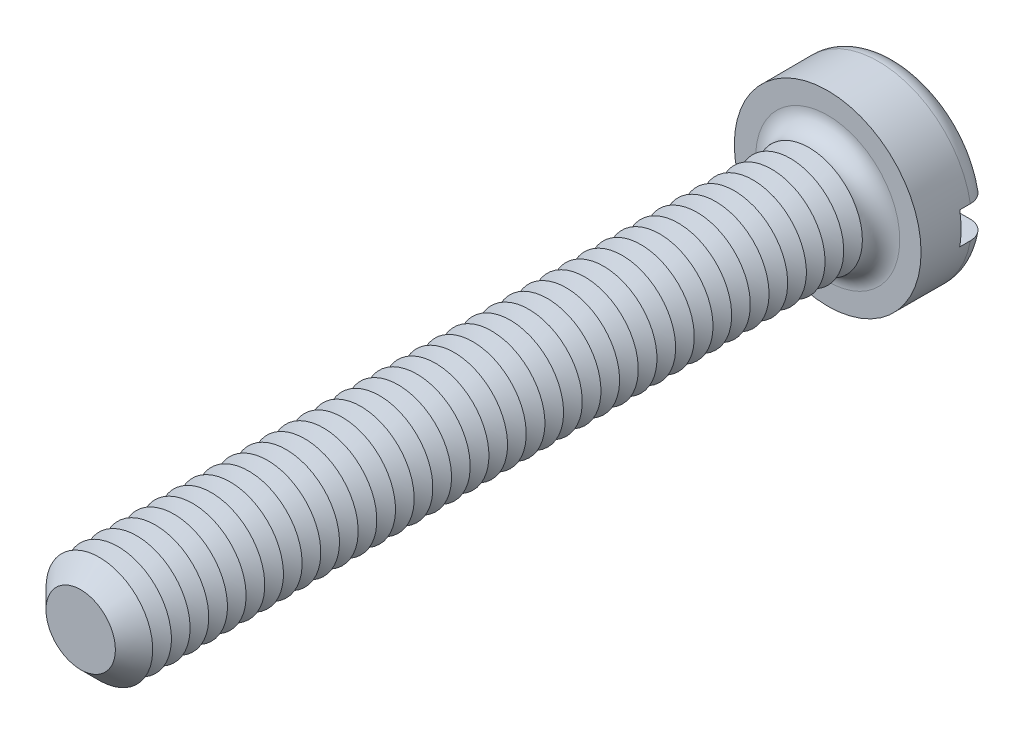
ISO-10303-21;
HEADER;
FILE_DESCRIPTION(('STEP AP214'),'2;1');
FILE_NAME('part.step','',(''),(''),'','','');
FILE_SCHEMA(('AUTOMOTIVE_DESIGN { 1 0 10303 214 1 1 1 1 }'));
ENDSEC;
DATA;
#1=APPLICATION_CONTEXT('core data for automotive mechanical design processes');
#2=APPLICATION_PROTOCOL_DEFINITION('international standard','automotive_design',2000,#1);
#3=PRODUCT_CONTEXT('',#1,'mechanical');
#4=PRODUCT('Part','Part','',(#3));
#5=PRODUCT_RELATED_PRODUCT_CATEGORY('part','',(#4));
#6=PRODUCT_DEFINITION_FORMATION('','',#4);
#7=PRODUCT_DEFINITION_CONTEXT('part definition',#1,'design');
#8=PRODUCT_DEFINITION('design','',#6,#7);
#9=PRODUCT_DEFINITION_SHAPE('','',#8);
#10=(LENGTH_UNIT() NAMED_UNIT(*) SI_UNIT(.MILLI.,.METRE.));
#11=(NAMED_UNIT(*) PLANE_ANGLE_UNIT() SI_UNIT($,.RADIAN.));
#12=(NAMED_UNIT(*) SI_UNIT($,.STERADIAN.) SOLID_ANGLE_UNIT());
#13=UNCERTAINTY_MEASURE_WITH_UNIT(LENGTH_MEASURE(1.E-05),#10,'distance_accuracy_value','');
#14=(GEOMETRIC_REPRESENTATION_CONTEXT(3) GLOBAL_UNCERTAINTY_ASSIGNED_CONTEXT((#13)) GLOBAL_UNIT_ASSIGNED_CONTEXT((#10,
#11,#12)) REPRESENTATION_CONTEXT('',''));
#15=CARTESIAN_POINT('',(0.,0.,0.));
#16=DIRECTION('',(0.,0.,1.));
#17=DIRECTION('',(1.,0.,0.));
#18=AXIS2_PLACEMENT_3D('',#15,#16,#17);
#19=CARTESIAN_POINT('',(0.,0.,-2.6));
#20=DIRECTION('',(0.,0.,1.));
#21=DIRECTION('',(1.,0.,0.));
#22=AXIS2_PLACEMENT_3D('',#19,#20,#21);
#23=PLANE('',#22);
#24=CARTESIAN_POINT('',(0.,0.,-2.6));
#25=DIRECTION('',(0.,0.,1.));
#26=DIRECTION('',(1.,0.,0.));
#27=AXIS2_PLACEMENT_3D('',#24,#25,#26);
#28=CIRCLE('',#27,2.8);
#29=CARTESIAN_POINT('',(-2.73495886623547,0.6,-2.6));
#30=VERTEX_POINT('',#29);
#31=CARTESIAN_POINT('',(2.73495886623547,0.6,-2.6));
#32=VERTEX_POINT('',#31);
#33=EDGE_CURVE('E116',#30,#32,#28,.F.);
#34=ORIENTED_EDGE('',*,*,#33,.T.);
#35=DIRECTION('',(1.,0.,0.));
#36=VECTOR('',#35,1.);
#37=CARTESIAN_POINT('',(-3.5,0.600000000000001,-2.6));
#38=LINE('',#37,#36);
#39=EDGE_CURVE('E111',#30,#32,#38,.T.);
#40=ORIENTED_EDGE('',*,*,#39,.F.);
#41=EDGE_LOOP('',(#34,#40));
#42=FACE_BOUND('',#41,.T.);
#43=ADVANCED_FACE('F39',(#42),#23,.F.);
#44=CARTESIAN_POINT('',(0.,0.,-1.9));
#45=DIRECTION('',(0.,0.,1.));
#46=DIRECTION('',(1.,0.,0.));
#47=AXIS2_PLACEMENT_3D('',#44,#45,#46);
#48=TOROIDAL_SURFACE('',#47,2.8,0.7);
#49=CARTESIAN_POINT('',(-3.24550494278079,0.600000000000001,-2.38938679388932));
#50=CARTESIAN_POINT('',(-3.21724139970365,0.600000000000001,-2.41780774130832));
#51=CARTESIAN_POINT('',(-3.18652103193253,0.600000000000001,-2.44383169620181));
#52=CARTESIAN_POINT('',(-3.12110229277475,0.600000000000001,-2.49034599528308));
#53=CARTESIAN_POINT('',(-3.08639834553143,0.6,-2.51082844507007));
#54=CARTESIAN_POINT('',(-3.01410013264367,0.6,-2.54568075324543));
#55=CARTESIAN_POINT('',(-2.97650963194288,0.6,-2.56005841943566));
#56=CARTESIAN_POINT('',(-2.89948250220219,0.6,-2.58239238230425));
#57=CARTESIAN_POINT('',(-2.86004633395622,0.6,-2.59035027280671));
#58=CARTESIAN_POINT('',(-2.77983715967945,0.6,-2.5997577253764));
#59=CARTESIAN_POINT('',(-2.73905311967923,0.6,-2.60111317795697));
#60=CARTESIAN_POINT('',(-2.65781876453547,0.6,-2.59706866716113));
#61=CARTESIAN_POINT('',(-2.61736849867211,0.6,-2.59166772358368));
#62=CARTESIAN_POINT('',(-2.53729983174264,0.6,-2.57414594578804));
#63=CARTESIAN_POINT('',(-2.49770360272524,0.6,-2.56192363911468));
#64=CARTESIAN_POINT('',(-2.421111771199,0.6,-2.5310238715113));
#65=CARTESIAN_POINT('',(-2.38411632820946,0.6,-2.51234601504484));
#66=CARTESIAN_POINT('',(-2.31371213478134,0.6,-2.46896762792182));
#67=CARTESIAN_POINT('',(-2.28031240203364,0.6,-2.44425244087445));
#68=CARTESIAN_POINT('',(-2.21823311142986,0.6,-2.38946667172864));
#69=CARTESIAN_POINT('',(-2.18955321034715,0.6,-2.35939647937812));
#70=CARTESIAN_POINT('',(-2.13836074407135,0.6,-2.29532787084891));
#71=CARTESIAN_POINT('',(-2.11574147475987,0.6,-2.26141482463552));
#72=CARTESIAN_POINT('',(-2.07677080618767,0.6,-2.19015935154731));
#73=CARTESIAN_POINT('',(-2.06041784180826,0.6,-2.15281778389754));
#74=CARTESIAN_POINT('',(-2.03508596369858,0.6,-2.07723332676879));
#75=CARTESIAN_POINT('',(-2.02585871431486,0.6,-2.03907365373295));
#76=CARTESIAN_POINT('',(-2.01416722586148,0.6,-1.96173417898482));
#77=CARTESIAN_POINT('',(-2.01170151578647,0.6,-1.92255460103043));
#78=CARTESIAN_POINT('',(-2.01359934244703,0.6,-1.84555709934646));
#79=CARTESIAN_POINT('',(-2.01775787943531,0.6,-1.80773393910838));
#80=CARTESIAN_POINT('',(-2.03236373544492,0.6,-1.73332511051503));
#81=CARTESIAN_POINT('',(-2.04281097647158,0.6,-1.69673942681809));
#82=CARTESIAN_POINT('',(-2.06962963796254,0.6,-1.62577336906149));
#83=CARTESIAN_POINT('',(-2.08600685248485,0.6,-1.59139519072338));
#84=CARTESIAN_POINT('',(-2.12413495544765,0.6,-1.52576356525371));
#85=CARTESIAN_POINT('',(-2.14588657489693,0.6,-1.49451054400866));
#86=CARTESIAN_POINT('',(-2.19483541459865,0.6,-1.43498643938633));
#87=CARTESIAN_POINT('',(-2.22217844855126,0.6,-1.40683532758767));
#88=CARTESIAN_POINT('',(-2.28105616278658,0.6,-1.35532544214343));
#89=CARTESIAN_POINT('',(-2.3125916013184,0.6,-1.33196753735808));
#90=CARTESIAN_POINT('',(-2.38018779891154,0.6,-1.28984356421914));
#91=CARTESIAN_POINT('',(-2.41637068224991,0.6,-1.27127330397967));
#92=CARTESIAN_POINT('',(-2.49129688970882,0.6,-1.24032971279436));
#93=CARTESIAN_POINT('',(-2.53004053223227,0.6,-1.22795715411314));
#94=CARTESIAN_POINT('',(-2.6098393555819,0.6,-1.2095515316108));
#95=CARTESIAN_POINT('',(-2.65092550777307,0.6,-1.20365237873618));
#96=CARTESIAN_POINT('',(-2.7335069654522,0.6,-1.1988380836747));
#97=CARTESIAN_POINT('',(-2.7750022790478,0.6,-1.19992308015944));
#98=CARTESIAN_POINT('',(-2.85718851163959,0.6,-1.20909046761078));
#99=CARTESIAN_POINT('',(-2.8978799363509,0.6,-1.21716830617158));
#100=CARTESIAN_POINT('',(-2.97729176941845,0.6,-1.24014327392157));
#101=CARTESIAN_POINT('',(-3.01601231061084,0.6,-1.25503994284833));
#102=CARTESIAN_POINT('',(-3.08976822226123,0.6,-1.29101066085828));
#103=CARTESIAN_POINT('',(-3.12484927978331,0.600000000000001,-1.31199098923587));
#104=CARTESIAN_POINT('',(-3.19090022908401,0.600000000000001,-1.35965144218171));
#105=CARTESIAN_POINT('',(-3.22187053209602,0.600000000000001,-1.38633099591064));
#106=CARTESIAN_POINT('',(-3.2781946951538,0.600000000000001,-1.44408564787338));
#107=CARTESIAN_POINT('',(-3.3036441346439,0.600000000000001,-1.47506754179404));
#108=CARTESIAN_POINT('',(-3.34887649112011,0.600000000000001,-1.54092398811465));
#109=CARTESIAN_POINT('',(-3.36865993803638,0.600000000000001,-1.57579817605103));
#110=CARTESIAN_POINT('',(-3.40166738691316,0.600000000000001,-1.64783067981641));
#111=CARTESIAN_POINT('',(-3.41499360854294,0.600000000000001,-1.68494217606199));
#112=CARTESIAN_POINT('',(-3.43515375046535,0.600000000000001,-1.76088675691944));
#113=CARTESIAN_POINT('',(-3.44198836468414,0.600000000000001,-1.79971965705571));
#114=CARTESIAN_POINT('',(-3.44891916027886,0.600000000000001,-1.87757893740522));
#115=CARTESIAN_POINT('',(-3.44908375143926,0.600000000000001,-1.91659924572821));
#116=CARTESIAN_POINT('',(-3.44284111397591,0.600000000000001,-1.99412088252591));
#117=CARTESIAN_POINT('',(-3.43643236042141,0.600000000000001,-2.03262208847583));
#118=CARTESIAN_POINT('',(-3.41725803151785,0.600000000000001,-2.10792315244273));
#119=CARTESIAN_POINT('',(-3.40450469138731,0.600000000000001,-2.14472613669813));
#120=CARTESIAN_POINT('',(-3.3730385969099,0.600000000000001,-2.21565060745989));
#121=CARTESIAN_POINT('',(-3.35433321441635,0.600000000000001,-2.24977534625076));
#122=CARTESIAN_POINT('',(-3.3201892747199,0.600000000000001,-2.30136364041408));
#123=CARTESIAN_POINT('',(-3.30647805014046,0.600000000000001,-2.31999402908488));
#124=CARTESIAN_POINT('',(-3.27728518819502,0.600000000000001,-2.35581090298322));
#125=CARTESIAN_POINT('',(-3.26180356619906,0.600000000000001,-2.37299740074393));
#126=CARTESIAN_POINT('',(-3.24550494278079,0.600000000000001,-2.38938679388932));
#127=B_SPLINE_CURVE_WITH_KNOTS('',3,(#49,#50,#51,#52,#53,#54,#55,#56,#57,#58,#59,#60,#61,#62,
#63,#64,#65,#66,#67,#68,#69,#70,#71,#72,#73,#74,#75,#76,#77,#78,#79,#80,#81,#82,#83,#84,#85,#86,
#87,#88,#89,#90,#91,#92,#93,#94,#95,#96,#97,#98,#99,#100,#101,#102,#103,#104,#105,#106,#107,
#108,#109,#110,#111,#112,#113,#114,#115,#116,#117,#118,#119,#120,#121,#122,#123,#124,#125,#126),
.UNSPECIFIED.,.T.,.F.,(4,2,2,2,2,2,2,2,2,2,2,2,2,2,2,2,2,2,2,2,2,2,2,2,2,2,2,2,2,2,2,2,2,2,2,2,
2,2,4),(0.,0.120160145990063,0.240490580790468,0.36066665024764,0.480812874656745,
0.602666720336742,0.724538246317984,0.848272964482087,0.972015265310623,1.09606100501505,
1.2200977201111,1.34178071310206,1.46343329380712,1.58062647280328,1.6977941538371,
1.81140573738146,1.92501591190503,2.03873739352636,2.15247435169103,2.26967910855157,
2.38690509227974,2.50835551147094,2.62982106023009,2.75375450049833,2.87769040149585,
3.00154567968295,3.12539259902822,3.24742469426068,3.36944457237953,3.48914477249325,
3.60883377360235,3.72656056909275,3.84427477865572,3.96078136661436,4.07731498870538,
4.19362474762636,4.3097910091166,4.37908387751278,4.44837614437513),.UNSPECIFIED.);
#128=CARTESIAN_POINT('',(-3.44818792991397,0.600000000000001,-1.8999999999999));
#129=VERTEX_POINT('',#128);
#130=EDGE_CURVE('E483',#129,#30,#127,.T.);
#131=ORIENTED_EDGE('',*,*,#130,.F.);
#132=CARTESIAN_POINT('',(0.,0.,-1.9));
#133=DIRECTION('',(0.,0.,1.));
#134=DIRECTION('',(1.,0.,0.));
#135=AXIS2_PLACEMENT_3D('',#132,#133,#134);
#136=CIRCLE('',#135,3.5);
#137=CARTESIAN_POINT('',(3.44818792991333,0.6,-1.9));
#138=VERTEX_POINT('',#137);
#139=EDGE_CURVE('E125',#138,#129,#136,.T.);
#140=ORIENTED_EDGE('',*,*,#139,.F.);
#141=CARTESIAN_POINT('',(2.1414268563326,0.6,-2.29762171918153));
#142=CARTESIAN_POINT('',(2.16505443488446,0.6,-2.33058245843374));
#143=CARTESIAN_POINT('',(2.19155609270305,0.6,-2.36152717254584));
#144=CARTESIAN_POINT('',(2.24942944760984,0.6,-2.41852964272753));
#145=CARTESIAN_POINT('',(2.28080921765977,0.6,-2.44457913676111));
#146=CARTESIAN_POINT('',(2.34741203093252,0.6,-2.49105381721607));
#147=CARTESIAN_POINT('',(2.38262862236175,0.6,-2.51148824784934));
#148=CARTESIAN_POINT('',(2.45593176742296,0.6,-2.54626881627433));
#149=CARTESIAN_POINT('',(2.49401741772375,0.6,-2.56061686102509));
#150=CARTESIAN_POINT('',(2.57272605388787,0.6,-2.58306429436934));
#151=CARTESIAN_POINT('',(2.6133821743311,0.6,-2.59104769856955));
#152=CARTESIAN_POINT('',(2.6954618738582,0.6,-2.60009608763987));
#153=CARTESIAN_POINT('',(2.73688552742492,0.6,-2.60116039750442));
#154=CARTESIAN_POINT('',(2.81941950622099,0.6,-2.5962925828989));
#155=CARTESIAN_POINT('',(2.86052888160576,0.6,-2.59034422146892));
#156=CARTESIAN_POINT('',(2.94113709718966,0.6,-2.57153687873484));
#157=CARTESIAN_POINT('',(2.98063603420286,0.6,-2.55867831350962));
#158=CARTESIAN_POINT('',(3.05633735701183,0.6,-2.52657771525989));
#159=CARTESIAN_POINT('',(3.09257627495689,0.6,-2.50742188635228));
#160=CARTESIAN_POINT('',(3.16123898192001,0.6,-2.46318606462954));
#161=CARTESIAN_POINT('',(3.19366316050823,0.6,-2.4381066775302));
#162=CARTESIAN_POINT('',(3.25312278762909,0.6,-2.38324481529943));
#163=CARTESIAN_POINT('',(3.28024842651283,0.6,-2.35356008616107));
#164=CARTESIAN_POINT('',(3.32902587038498,0.6,-2.28998971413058));
#165=CARTESIAN_POINT('',(3.35067820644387,0.6,-2.25610447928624));
#166=CARTESIAN_POINT('',(3.38751207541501,0.6,-2.18572286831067));
#167=CARTESIAN_POINT('',(3.40279804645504,0.6,-2.14928112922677));
#168=CARTESIAN_POINT('',(3.42695590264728,0.6,-2.07433042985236));
#169=CARTESIAN_POINT('',(3.43582824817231,0.6,-2.03582161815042));
#170=CARTESIAN_POINT('',(3.44682113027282,0.6,-1.95829536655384));
#171=CARTESIAN_POINT('',(3.44901648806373,0.6,-1.91928851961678));
#172=CARTESIAN_POINT('',(3.44680085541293,0.6,-1.84146366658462));
#173=CARTESIAN_POINT('',(3.44239008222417,0.6,-1.80264565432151));
#174=CARTESIAN_POINT('',(3.42712544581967,0.6,-1.72644634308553));
#175=CARTESIAN_POINT('',(3.41629508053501,0.6,-1.6890603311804));
#176=CARTESIAN_POINT('',(3.38853757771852,0.6,-1.61662604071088));
#177=CARTESIAN_POINT('',(3.37161039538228,0.6,-1.58157777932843));
#178=CARTESIAN_POINT('',(3.33207798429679,0.6,-1.51464178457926));
#179=CARTESIAN_POINT('',(3.30944854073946,0.6,-1.48276835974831));
#180=CARTESIAN_POINT('',(3.2592165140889,0.6,-1.42321861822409));
#181=CARTESIAN_POINT('',(3.23161370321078,0.6,-1.3955424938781));
#182=CARTESIAN_POINT('',(3.17188519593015,0.6,-1.34481834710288));
#183=CARTESIAN_POINT('',(3.13971065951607,0.6,-1.32182785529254));
#184=CARTESIAN_POINT('',(3.07201123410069,0.6,-1.28147003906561));
#185=CARTESIAN_POINT('',(3.03648608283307,0.6,-1.26410315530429));
#186=CARTESIAN_POINT('',(2.962449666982,0.6,-1.2351645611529));
#187=CARTESIAN_POINT('',(2.92389781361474,0.6,-1.22369671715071));
#188=CARTESIAN_POINT('',(2.84543273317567,0.6,-1.20726565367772));
#189=CARTESIAN_POINT('',(2.80551936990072,0.6,-1.20230308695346));
#190=CARTESIAN_POINT('',(2.72467191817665,0.6,-1.1989357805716));
#191=CARTESIAN_POINT('',(2.68373266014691,0.6,-1.20065484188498));
#192=CARTESIAN_POINT('',(2.60270222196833,0.6,-1.21084560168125));
#193=CARTESIAN_POINT('',(2.56261112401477,0.6,-1.21931795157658));
#194=CARTESIAN_POINT('',(2.48385954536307,0.6,-1.24292934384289));
#195=CARTESIAN_POINT('',(2.44522508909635,0.6,-1.25815531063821));
#196=CARTESIAN_POINT('',(2.37106165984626,0.6,-1.29488663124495));
#197=CARTESIAN_POINT('',(2.33553282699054,0.6,-1.31639226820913));
#198=CARTESIAN_POINT('',(2.2686996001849,0.6,-1.36507949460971));
#199=CARTESIAN_POINT('',(2.23738745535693,0.6,-1.39225042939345));
#200=CARTESIAN_POINT('',(2.17990424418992,0.6,-1.45157941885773));
#201=CARTESIAN_POINT('',(2.15373259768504,0.6,-1.48373691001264));
#202=CARTESIAN_POINT('',(2.10799355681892,0.6,-1.551327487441));
#203=CARTESIAN_POINT('',(2.08828258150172,0.6,-1.58666329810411));
#204=CARTESIAN_POINT('',(2.05534440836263,0.6,-1.66023600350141));
#205=CARTESIAN_POINT('',(2.042115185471,0.6,-1.6984719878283));
#206=CARTESIAN_POINT('',(2.02303126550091,0.6,-1.77519783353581));
#207=CARTESIAN_POINT('',(2.01691541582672,0.6,-1.8136228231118));
#208=CARTESIAN_POINT('',(2.01140375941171,0.6,-1.89096056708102));
#209=CARTESIAN_POINT('',(2.01200856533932,0.6,-1.92987336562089));
#210=CARTESIAN_POINT('',(2.01981617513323,0.6,-2.006065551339));
#211=CARTESIAN_POINT('',(2.02685835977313,0.6,-2.04336165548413));
#212=CARTESIAN_POINT('',(2.0470502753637,0.6,-2.1162250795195));
#213=CARTESIAN_POINT('',(2.06019252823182,0.6,-2.15179445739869));
#214=CARTESIAN_POINT('',(2.08525738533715,0.6,-2.20558874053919));
#215=CARTESIAN_POINT('',(2.09529161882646,0.6,-2.22471751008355));
#216=CARTESIAN_POINT('',(2.11708813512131,0.6,-2.26196179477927));
#217=CARTESIAN_POINT('',(2.12885034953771,0.6,-2.28007734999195));
#218=CARTESIAN_POINT('',(2.1414268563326,0.6,-2.29762171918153));
#219=B_SPLINE_CURVE_WITH_KNOTS('',3,(#141,#142,#143,#144,#145,#146,#147,#148,#149,#150,#151,
#152,#153,#154,#155,#156,#157,#158,#159,#160,#161,#162,#163,#164,#165,#166,#167,#168,#169,#170,
#171,#172,#173,#174,#175,#176,#177,#178,#179,#180,#181,#182,#183,#184,#185,#186,#187,#188,#189,
#190,#191,#192,#193,#194,#195,#196,#197,#198,#199,#200,#201,#202,#203,#204,#205,#206,#207,#208,
#209,#210,#211,#212,#213,#214,#215,#216,#217,#218),.UNSPECIFIED.,.T.,.F.,(4,2,2,2,2,2,2,2,2,2,2,
2,2,2,2,2,2,2,2,2,2,2,2,2,2,2,2,2,2,2,2,2,2,2,2,2,2,2,4),(0.,0.121582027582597,
0.243367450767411,0.364951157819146,0.486496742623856,0.610209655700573,0.733934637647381,
0.857946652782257,0.981951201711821,1.1043243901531,1.22668507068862,1.34673532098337,
1.46677391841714,1.58475736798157,1.70273234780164,1.81938035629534,1.93602452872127,
2.05224435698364,2.168465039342,2.28518782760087,2.40191596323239,2.52000081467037,
2.63809491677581,2.75820270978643,2.87832255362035,3.00067856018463,3.1230463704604,
3.24703703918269,3.37103329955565,3.49479843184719,3.6185495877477,3.73932715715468,
3.86006696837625,3.9762182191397,4.09238005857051,4.2057203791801,4.31892212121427,
4.38364046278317,4.44835624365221),.UNSPECIFIED.);
#220=EDGE_CURVE('E485',#32,#138,#219,.T.);
#221=ORIENTED_EDGE('',*,*,#220,.F.);
#222=ORIENTED_EDGE('',*,*,#33,.F.);
#223=EDGE_LOOP('',(#131,#140,#221,#222));
#224=FACE_BOUND('',#223,.T.);
#225=ADVANCED_FACE('F467',(#224),#48,.T.);
#226=CARTESIAN_POINT('',(0.,0.,-2.6));
#227=DIRECTION('',(0.,0.,1.));
#228=DIRECTION('',(1.,0.,0.));
#229=AXIS2_PLACEMENT_3D('',#226,#227,#228);
#230=CYLINDRICAL_SURFACE('',#229,3.5);
#231=DIRECTION('',(0.,0.,1.));
#232=VECTOR('',#231,1.);
#233=CARTESIAN_POINT('',(3.44818792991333,0.6,-2.6));
#234=LINE('',#233,#232);
#235=CARTESIAN_POINT('',(3.44818792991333,0.6,-1.5));
#236=VERTEX_POINT('',#235);
#237=EDGE_CURVE('E500',#138,#236,#234,.T.);
#238=ORIENTED_EDGE('',*,*,#237,.F.);
#239=ORIENTED_EDGE('',*,*,#139,.T.);
#240=DIRECTION('',(0.,0.,1.));
#241=VECTOR('',#240,1.);
#242=CARTESIAN_POINT('',(-3.44818792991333,0.600000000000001,-2.6));
#243=LINE('',#242,#241);
#244=CARTESIAN_POINT('',(-3.44818792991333,0.600000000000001,-1.5));
#245=VERTEX_POINT('',#244);
#246=EDGE_CURVE('E63',#245,#129,#243,.F.);
#247=ORIENTED_EDGE('',*,*,#246,.F.);
#248=CARTESIAN_POINT('',(0.,0.,-1.5));
#249=DIRECTION('',(0.,0.,-1.));
#250=DIRECTION('',(-1.,0.,0.));
#251=AXIS2_PLACEMENT_3D('',#248,#249,#250);
#252=CIRCLE('',#251,3.5);
#253=CARTESIAN_POINT('',(-3.44818792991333,-0.599999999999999,-1.5));
#254=VERTEX_POINT('',#253);
#255=EDGE_CURVE('E43',#245,#254,#252,.F.);
#256=ORIENTED_EDGE('',*,*,#255,.T.);
#257=DIRECTION('',(0.,0.,1.));
#258=VECTOR('',#257,1.);
#259=CARTESIAN_POINT('',(-3.44818792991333,-0.599999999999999,-2.6));
#260=LINE('',#259,#258);
#261=CARTESIAN_POINT('',(-3.44818792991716,-0.599999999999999,-1.90000000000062));
#262=VERTEX_POINT('',#261);
#263=EDGE_CURVE('E497',#262,#254,#260,.T.);
#264=ORIENTED_EDGE('',*,*,#263,.F.);
#265=CARTESIAN_POINT('',(3.44818792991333,-0.6,-1.9));
#266=VERTEX_POINT('',#265);
#267=EDGE_CURVE('E127',#262,#266,#136,.T.);
#268=ORIENTED_EDGE('',*,*,#267,.T.);
#269=DIRECTION('',(0.,0.,1.));
#270=VECTOR('',#269,1.);
#271=CARTESIAN_POINT('',(3.44818792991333,-0.6,-2.6));
#272=LINE('',#271,#270);
#273=CARTESIAN_POINT('',(3.44818792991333,-0.6,-1.5));
#274=VERTEX_POINT('',#273);
#275=EDGE_CURVE('E55',#274,#266,#272,.F.);
#276=ORIENTED_EDGE('',*,*,#275,.F.);
#277=EDGE_CURVE('E11',#274,#236,#252,.F.);
#278=ORIENTED_EDGE('',*,*,#277,.T.);
#279=EDGE_LOOP('',(#238,#239,#247,#256,#264,#268,#276,#278));
#280=FACE_BOUND('',#279,.T.);
#281=CARTESIAN_POINT('',(0.,0.,0.));
#282=DIRECTION('',(0.,0.,1.));
#283=DIRECTION('',(1.,0.,0.));
#284=AXIS2_PLACEMENT_3D('',#281,#282,#283);
#285=CIRCLE('',#284,3.5);
#286=CARTESIAN_POINT('',(3.5,0.,0.));
#287=VERTEX_POINT('',#286);
#288=EDGE_CURVE('E503',#287,#287,#285,.T.);
#289=ORIENTED_EDGE('',*,*,#288,.F.);
#290=EDGE_LOOP('',(#289));
#291=FACE_BOUND('',#290,.T.);
#292=ADVANCED_FACE('F463',(#280,#291),#230,.T.);
#293=CARTESIAN_POINT('',(2.73495886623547,-0.6,-2.6));
#294=VERTEX_POINT('',#293);
#295=CARTESIAN_POINT('',(-2.73495886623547,-0.6,-2.6));
#296=VERTEX_POINT('',#295);
#297=EDGE_CURVE('E109',#294,#296,#28,.F.);
#298=ORIENTED_EDGE('',*,*,#297,.T.);
#299=DIRECTION('',(-1.,0.,0.));
#300=VECTOR('',#299,1.);
#301=CARTESIAN_POINT('',(-3.5,-0.599999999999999,-2.6));
#302=LINE('',#301,#300);
#303=EDGE_CURVE('E96',#294,#296,#302,.T.);
#304=ORIENTED_EDGE('',*,*,#303,.F.);
#305=EDGE_LOOP('',(#298,#304));
#306=FACE_BOUND('',#305,.T.);
#307=ADVANCED_FACE('F108',(#306),#23,.F.);
#308=CARTESIAN_POINT('',(0.,0.,0.));
#309=DIRECTION('',(0.,0.,1.));
#310=DIRECTION('',(1.,0.,0.));
#311=AXIS2_PLACEMENT_3D('',#308,#309,#310);
#312=PLANE('',#311);
#313=CARTESIAN_POINT('',(0.,0.,0.));
#314=DIRECTION('',(0.,0.,1.));
#315=DIRECTION('',(1.,0.,0.));
#316=AXIS2_PLACEMENT_3D('',#313,#314,#315);
#317=CIRCLE('',#316,2.7);
#318=CARTESIAN_POINT('',(2.7,0.,0.));
#319=VERTEX_POINT('',#318);
#320=EDGE_CURVE('E115',#319,#319,#317,.F.);
#321=ORIENTED_EDGE('',*,*,#320,.T.);
#322=EDGE_LOOP('',(#321));
#323=FACE_BOUND('',#322,.T.);
#324=ORIENTED_EDGE('',*,*,#288,.T.);
#325=EDGE_LOOP('',(#324));
#326=FACE_BOUND('',#325,.T.);
#327=ADVANCED_FACE('F462',(#323,#326),#312,.T.);
#328=CARTESIAN_POINT('',(-3.24550494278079,-0.599999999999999,-2.38938679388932));
#329=CARTESIAN_POINT('',(-3.27309693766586,-0.599999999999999,-2.36163611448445));
#330=CARTESIAN_POINT('',(-3.29838741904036,-0.599999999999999,-2.3315608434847));
#331=CARTESIAN_POINT('',(-3.34359429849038,-0.599999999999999,-2.26757659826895));
#332=CARTESIAN_POINT('',(-3.36350518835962,-0.599999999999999,-2.23366374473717));
#333=CARTESIAN_POINT('',(-3.39733065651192,-0.599999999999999,-2.16296274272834));
#334=CARTESIAN_POINT('',(-3.4112451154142,-0.599999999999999,-2.12617453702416));
#335=CARTESIAN_POINT('',(-3.43264462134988,-0.599999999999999,-2.05078178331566));
#336=CARTESIAN_POINT('',(-3.44013114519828,-0.599999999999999,-2.01217765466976));
#337=CARTESIAN_POINT('',(-3.44841975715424,-0.599999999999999,-1.9345391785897));
#338=CARTESIAN_POINT('',(-3.44926944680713,-0.599999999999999,-1.89550990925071));
#339=CARTESIAN_POINT('',(-3.44438358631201,-0.599999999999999,-1.81786552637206));
#340=CARTESIAN_POINT('',(-3.43864801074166,-0.599999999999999,-1.77925041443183));
#341=CARTESIAN_POINT('',(-3.42079221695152,-0.599999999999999,-1.70364264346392));
#342=CARTESIAN_POINT('',(-3.40869011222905,-0.599999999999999,-1.66664570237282));
#343=CARTESIAN_POINT('',(-3.37847692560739,-0.599999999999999,-1.59519424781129));
#344=CARTESIAN_POINT('',(-3.3603657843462,-0.599999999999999,-1.56073975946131));
#345=CARTESIAN_POINT('',(-3.31856549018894,-0.599999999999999,-1.4951524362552));
#346=CARTESIAN_POINT('',(-3.29484830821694,-0.599999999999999,-1.46403747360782));
#347=CARTESIAN_POINT('',(-3.24258489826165,-0.599999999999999,-1.40617131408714));
#348=CARTESIAN_POINT('',(-3.21403843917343,-0.599999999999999,-1.37942032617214));
#349=CARTESIAN_POINT('',(-3.15256084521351,-0.599999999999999,-1.33067963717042));
#350=CARTESIAN_POINT('',(-3.11958015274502,-0.599999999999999,-1.30875246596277));
#351=CARTESIAN_POINT('',(-3.0504559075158,-0.599999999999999,-1.27063718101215));
#352=CARTESIAN_POINT('',(-3.01431209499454,-0.6,-1.25444953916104));
#353=CARTESIAN_POINT('',(-2.93921710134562,-0.6,-1.22796796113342));
#354=CARTESIAN_POINT('',(-2.90022796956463,-0.6,-1.217781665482));
#355=CARTESIAN_POINT('',(-2.82110512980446,-0.6,-1.20396915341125));
#356=CARTESIAN_POINT('',(-2.7809713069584,-0.6,-1.2003435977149));
#357=CARTESIAN_POINT('',(-2.69990924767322,-0.6,-1.19969717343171));
#358=CARTESIAN_POINT('',(-2.65898001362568,-0.6,-1.20279937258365));
#359=CARTESIAN_POINT('',(-2.57819986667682,-0.6,-1.21574287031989));
#360=CARTESIAN_POINT('',(-2.53834905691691,-0.6,-1.22558481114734));
#361=CARTESIAN_POINT('',(-2.46035232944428,-0.6,-1.25189361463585));
#362=CARTESIAN_POINT('',(-2.42223314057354,-0.6,-1.2684398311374));
#363=CARTESIAN_POINT('',(-2.34932316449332,-0.6,-1.30771928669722));
#364=CARTESIAN_POINT('',(-2.31453248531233,-0.6,-1.33045272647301));
#365=CARTESIAN_POINT('',(-2.24945577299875,-0.6,-1.38141543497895));
#366=CARTESIAN_POINT('',(-2.21915255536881,-0.6,-1.40962272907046));
#367=CARTESIAN_POINT('',(-2.16386461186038,-0.6,-1.47084552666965));
#368=CARTESIAN_POINT('',(-2.13887916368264,-0.6,-1.50386037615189));
#369=CARTESIAN_POINT('',(-2.09568071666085,-0.6,-1.57285917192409));
#370=CARTESIAN_POINT('',(-2.07730739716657,-0.6,-1.60874263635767));
#371=CARTESIAN_POINT('',(-2.04712019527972,-0.6,-1.68316975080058));
#372=CARTESIAN_POINT('',(-2.03530452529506,-0.6,-1.72171267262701));
#373=CARTESIAN_POINT('',(-2.01901751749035,-0.6,-1.79878952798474));
#374=CARTESIAN_POINT('',(-2.01428434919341,-0.6,-1.8372682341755));
#375=CARTESIAN_POINT('',(-2.01150652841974,-0.6,-1.91446369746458));
#376=CARTESIAN_POINT('',(-2.01346084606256,-0.6,-1.95318041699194));
#377=CARTESIAN_POINT('',(-2.02386268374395,-0.6,-2.0288619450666));
#378=CARTESIAN_POINT('',(-2.03216724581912,-0.6,-2.06584654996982));
#379=CARTESIAN_POINT('',(-2.05479337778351,-0.6,-2.13792373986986));
#380=CARTESIAN_POINT('',(-2.06911522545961,-0.6,-2.1730162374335));
#381=CARTESIAN_POINT('',(-2.10349906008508,-0.6,-2.24081034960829));
#382=CARTESIAN_POINT('',(-2.12363007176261,-0.6,-2.27347689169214));
#383=CARTESIAN_POINT('',(-2.16891308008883,-0.6,-2.33511902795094));
#384=CARTESIAN_POINT('',(-2.19406590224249,-0.6,-2.36409401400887));
#385=CARTESIAN_POINT('',(-2.24962389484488,-0.6,-2.41861972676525));
#386=CARTESIAN_POINT('',(-2.28018314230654,-0.6,-2.44401345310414));
#387=CARTESIAN_POINT('',(-2.34501720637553,-0.6,-2.48950558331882));
#388=CARTESIAN_POINT('',(-2.37929266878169,-0.6,-2.50960306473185));
#389=CARTESIAN_POINT('',(-2.45179417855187,-0.6,-2.54458276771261));
#390=CARTESIAN_POINT('',(-2.49011248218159,-0.6,-2.55927401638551));
#391=CARTESIAN_POINT('',(-2.56865227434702,-0.6,-2.58211133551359));
#392=CARTESIAN_POINT('',(-2.60887386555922,-0.6,-2.59025705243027));
#393=CARTESIAN_POINT('',(-2.69064746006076,-0.6,-2.59982905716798));
#394=CARTESIAN_POINT('',(-2.73220999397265,-0.6,-2.60116580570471));
#395=CARTESIAN_POINT('',(-2.81497658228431,-0.6,-2.59679700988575));
#396=CARTESIAN_POINT('',(-2.85618055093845,-0.6,-2.59108982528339));
#397=CARTESIAN_POINT('',(-2.93677683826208,-0.6,-2.57279487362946));
#398=CARTESIAN_POINT('',(-2.97617834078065,-0.6,-2.56024753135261));
#399=CARTESIAN_POINT('',(-3.05222242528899,-0.6,-2.52860709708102));
#400=CARTESIAN_POINT('',(-3.08886850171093,-0.599999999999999,-2.50952247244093));
#401=CARTESIAN_POINT('',(-3.14562501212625,-0.599999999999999,-2.47340693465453));
#402=CARTESIAN_POINT('',(-3.16689358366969,-0.599999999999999,-2.45816337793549));
#403=CARTESIAN_POINT('',(-3.20761866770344,-0.599999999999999,-2.42542115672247));
#404=CARTESIAN_POINT('',(-3.22707520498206,-0.599999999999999,-2.40792252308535));
#405=CARTESIAN_POINT('',(-3.24550494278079,-0.599999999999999,-2.38938679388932));
#406=B_SPLINE_CURVE_WITH_KNOTS('',3,(#328,#329,#330,#331,#332,#333,#334,#335,#336,#337,#338,
#339,#340,#341,#342,#343,#344,#345,#346,#347,#348,#349,#350,#351,#352,#353,#354,#355,#356,#357,
#358,#359,#360,#361,#362,#363,#364,#365,#366,#367,#368,#369,#370,#371,#372,#373,#374,#375,#376,
#377,#378,#379,#380,#381,#382,#383,#384,#385,#386,#387,#388,#389,#390,#391,#392,#393,#394,#395,
#396,#397,#398,#399,#400,#401,#402,#403,#404,#405),.UNSPECIFIED.,.T.,.F.,(4,2,2,2,2,2,2,2,2,2,2,
2,2,2,2,2,2,2,2,2,2,2,2,2,2,2,2,2,2,2,2,2,2,2,2,2,2,2,4),(0.,0.117306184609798,
0.234732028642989,0.352160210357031,0.469561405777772,0.586119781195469,0.702678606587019,
0.818907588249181,0.935137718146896,1.05196174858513,1.1687913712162,1.2870562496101,
1.40533084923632,1.52566688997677,1.64601504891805,1.76858322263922,1.89116307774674,
2.01523830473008,2.13931755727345,2.26290863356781,2.38648291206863,2.50681878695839,
2.62712184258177,2.74285697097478,2.85857427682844,2.97176054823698,3.08495204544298,
3.19954814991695,3.31416310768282,3.43282436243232,3.55150627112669,3.67404987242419,
3.79660009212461,3.92075778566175,4.04494439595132,4.16840490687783,4.29170610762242,
4.3700604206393,4.44841366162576),.UNSPECIFIED.);
#407=EDGE_CURVE('E103',#296,#262,#406,.T.);
#408=ORIENTED_EDGE('',*,*,#407,.F.);
#409=ORIENTED_EDGE('',*,*,#297,.F.);
#410=CARTESIAN_POINT('',(2.1414268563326,-0.6,-2.29762171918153));
#411=CARTESIAN_POINT('',(2.11900044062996,-0.6,-2.26633119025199));
#412=CARTESIAN_POINT('',(2.09913154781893,-0.6,-2.23318080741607));
#413=CARTESIAN_POINT('',(2.06517900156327,-0.6,-2.16401111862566));
#414=CARTESIAN_POINT('',(2.05109968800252,-0.6,-2.12798968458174));
#415=CARTESIAN_POINT('',(2.02923593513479,-0.6,-2.05404277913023));
#416=CARTESIAN_POINT('',(2.02145692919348,-0.6,-2.01611569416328));
#417=CARTESIAN_POINT('',(2.01251710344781,-0.6,-1.93949649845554));
#418=CARTESIAN_POINT('',(2.01135461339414,-0.6,-1.90080458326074));
#419=CARTESIAN_POINT('',(2.01564803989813,-0.6,-1.82450508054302));
#420=CARTESIAN_POINT('',(2.02098305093,-0.6,-1.78689061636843));
#421=CARTESIAN_POINT('',(2.03786826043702,-0.6,-1.71308589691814));
#422=CARTESIAN_POINT('',(2.04941870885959,-0.6,-1.67689569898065));
#423=CARTESIAN_POINT('',(2.07838664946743,-0.6,-1.60676639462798));
#424=CARTESIAN_POINT('',(2.09582944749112,-0.6,-1.57283776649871));
#425=CARTESIAN_POINT('',(2.1359925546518,-0.6,-1.50826612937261));
#426=CARTESIAN_POINT('',(2.15871360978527,-0.6,-1.47762358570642));
#427=CARTESIAN_POINT('',(2.20955413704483,-0.6,-1.41943384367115));
#428=CARTESIAN_POINT('',(2.23782364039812,-0.6,-1.39201777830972));
#429=CARTESIAN_POINT('',(2.29842612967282,-0.6,-1.34212199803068));
#430=CARTESIAN_POINT('',(2.33075984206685,-0.6,-1.31964316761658));
#431=CARTESIAN_POINT('',(2.399806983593,-0.6,-1.27945238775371));
#432=CARTESIAN_POINT('',(2.43663466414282,-0.6,-1.26193653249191));
#433=CARTESIAN_POINT('',(2.51267241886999,-0.6,-1.23320660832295));
#434=CARTESIAN_POINT('',(2.55188277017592,-0.6,-1.22199327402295));
#435=CARTESIAN_POINT('',(2.63235000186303,-0.6,-1.20602688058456));
#436=CARTESIAN_POINT('',(2.673631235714,-0.6,-1.20139617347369));
#437=CARTESIAN_POINT('',(2.7563863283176,-0.6,-1.19914622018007));
#438=CARTESIAN_POINT('',(2.79786018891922,-0.6,-1.20152704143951));
#439=CARTESIAN_POINT('',(2.87971192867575,-0.6,-1.21326884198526));
#440=CARTESIAN_POINT('',(2.92009214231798,-0.6,-1.22261349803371));
#441=CARTESIAN_POINT('',(2.99866777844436,-0.6,-1.24805614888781));
#442=CARTESIAN_POINT('',(3.03686335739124,-0.6,-1.26415365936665));
#443=CARTESIAN_POINT('',(3.10934738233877,-0.6,-1.3023912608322));
#444=CARTESIAN_POINT('',(3.14368704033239,-0.6,-1.32443423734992));
#445=CARTESIAN_POINT('',(3.20808395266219,-0.6,-1.37407725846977));
#446=CARTESIAN_POINT('',(3.23814164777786,-0.6,-1.40167673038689));
#447=CARTESIAN_POINT('',(3.29251534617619,-0.6,-1.46108303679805));
#448=CARTESIAN_POINT('',(3.3169296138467,-0.6,-1.49279994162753));
#449=CARTESIAN_POINT('',(3.35998418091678,-0.6,-1.55993706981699));
#450=CARTESIAN_POINT('',(3.37862502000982,-0.6,-1.59535694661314));
#451=CARTESIAN_POINT('',(3.40930212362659,-0.6,-1.668283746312));
#452=CARTESIAN_POINT('',(3.42143897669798,-0.6,-1.70574837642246));
#453=CARTESIAN_POINT('',(3.43918305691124,-0.6,-1.78219297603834));
#454=CARTESIAN_POINT('',(3.44479069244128,-0.6,-1.82117285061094));
#455=CARTESIAN_POINT('',(3.44928173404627,-0.6,-1.89914596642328));
#456=CARTESIAN_POINT('',(3.44822835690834,-0.6,-1.93813558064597));
#457=CARTESIAN_POINT('',(3.43957811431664,-0.6,-2.0153811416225));
#458=CARTESIAN_POINT('',(3.43198139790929,-0.6,-2.05363710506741));
#459=CARTESIAN_POINT('',(3.41049386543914,-0.6,-2.12826741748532));
#460=CARTESIAN_POINT('',(3.39661362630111,-0.6,-2.16464481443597));
#461=CARTESIAN_POINT('',(3.36297924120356,-0.6,-2.23457274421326));
#462=CARTESIAN_POINT('',(3.34322499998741,-0.6,-2.26812323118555));
#463=CARTESIAN_POINT('',(3.29828706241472,-0.6,-2.33167864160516));
#464=CARTESIAN_POINT('',(3.27307040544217,-0.6,-2.36166024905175));
#465=CARTESIAN_POINT('',(3.21802069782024,-0.6,-2.41703165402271));
#466=CARTESIAN_POINT('',(3.18818738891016,-0.6,-2.44242119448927));
#467=CARTESIAN_POINT('',(3.12433871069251,-0.6,-2.48825551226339));
#468=CARTESIAN_POINT('',(3.09027338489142,-0.6,-2.50863067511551));
#469=CARTESIAN_POINT('',(3.01925175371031,-0.6,-2.54348754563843));
#470=CARTESIAN_POINT('',(2.982295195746,-0.6,-2.55796873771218));
#471=CARTESIAN_POINT('',(2.90583499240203,-0.6,-2.58090526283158));
#472=CARTESIAN_POINT('',(2.86629758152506,-0.6,-2.58924801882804));
#473=CARTESIAN_POINT('',(2.78639041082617,-0.6,-2.59930573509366));
#474=CARTESIAN_POINT('',(2.7460205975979,-0.6,-2.60102026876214));
#475=CARTESIAN_POINT('',(2.66482039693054,-0.6,-2.59779078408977));
#476=CARTESIAN_POINT('',(2.62399477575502,-0.6,-2.59272651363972));
#477=CARTESIAN_POINT('',(2.54373809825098,-0.6,-2.57588976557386));
#478=CARTESIAN_POINT('',(2.50430750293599,-0.6,-2.56411509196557));
#479=CARTESIAN_POINT('',(2.42753167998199,-0.6,-2.53401488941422));
#480=CARTESIAN_POINT('',(2.39021407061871,-0.6,-2.51561892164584));
#481=CARTESIAN_POINT('',(2.31925431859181,-0.6,-2.4727929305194));
#482=CARTESIAN_POINT('',(2.28560806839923,-0.6,-2.44836975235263));
#483=CARTESIAN_POINT('',(2.23316677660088,-0.6,-2.40295212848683));
#484=CARTESIAN_POINT('',(2.21309339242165,-0.6,-2.38341311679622));
#485=CARTESIAN_POINT('',(2.17537212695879,-0.6,-2.34211733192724));
#486=CARTESIAN_POINT('',(2.1577241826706,-0.6,-2.32036061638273));
#487=CARTESIAN_POINT('',(2.1414268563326,-0.6,-2.29762171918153));
#488=B_SPLINE_CURVE_WITH_KNOTS('',3,(#410,#411,#412,#413,#414,#415,#416,#417,#418,#419,#420,
#421,#422,#423,#424,#425,#426,#427,#428,#429,#430,#431,#432,#433,#434,#435,#436,#437,#438,#439,
#440,#441,#442,#443,#444,#445,#446,#447,#448,#449,#450,#451,#452,#453,#454,#455,#456,#457,#458,
#459,#460,#461,#462,#463,#464,#465,#466,#467,#468,#469,#470,#471,#472,#473,#474,#475,#476,#477,
#478,#479,#480,#481,#482,#483,#484,#485,#486,#487),.UNSPECIFIED.,.T.,.F.,(4,2,2,2,2,2,2,2,2,2,2,
2,2,2,2,2,2,2,2,2,2,2,2,2,2,2,2,2,2,2,2,2,2,2,2,2,2,2,4),(0.,0.115394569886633,
0.230875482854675,0.346455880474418,0.462007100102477,0.575440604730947,0.688878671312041,
0.802810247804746,0.91675793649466,1.03436780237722,1.15199872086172,1.27377854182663,
1.39557255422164,1.51960202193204,1.64363268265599,1.76737352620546,1.89110549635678,
2.01292743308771,2.13473682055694,2.25423121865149,2.37371444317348,2.49129215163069,
2.60886250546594,2.72531873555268,2.8417723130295,2.95803059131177,3.07429075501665,
3.19127301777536,3.30826182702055,3.42679321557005,3.54533497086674,3.66599996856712,
3.78667273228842,3.90951478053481,4.03239705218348,4.15662720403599,4.28071691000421,
4.36457658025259,4.44843407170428),.UNSPECIFIED.);
#489=EDGE_CURVE('E92',#266,#294,#488,.T.);
#490=ORIENTED_EDGE('',*,*,#489,.F.);
#491=ORIENTED_EDGE('',*,*,#267,.F.);
#492=EDGE_LOOP('',(#408,#409,#490,#491));
#493=FACE_BOUND('',#492,.T.);
#494=ADVANCED_FACE('F113',(#493),#48,.T.);
#495=CARTESIAN_POINT('',(0.,0.,0.699999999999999));
#496=DIRECTION('',(0.,0.,1.));
#497=DIRECTION('',(1.,0.,0.));
#498=AXIS2_PLACEMENT_3D('',#495,#496,#497);
#499=TOROIDAL_SURFACE('',#498,2.7,0.7);
#500=ORIENTED_EDGE('',*,*,#320,.F.);
#501=EDGE_LOOP('',(#500));
#502=FACE_BOUND('',#501,.T.);
#503=CARTESIAN_POINT('',(0.,0.,0.699999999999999));
#504=DIRECTION('',(0.,0.,-1.));
#505=DIRECTION('',(-1.,0.,0.));
#506=AXIS2_PLACEMENT_3D('',#503,#504,#505);
#507=CIRCLE('',#506,2.);
#508=CARTESIAN_POINT('',(-2.,0.,0.699999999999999));
#509=VERTEX_POINT('',#508);
#510=EDGE_CURVE('E509',#509,#509,#507,.T.);
#511=ORIENTED_EDGE('',*,*,#510,.T.);
#512=EDGE_LOOP('',(#511));
#513=FACE_BOUND('',#512,.T.);
#514=ADVANCED_FACE('F455',(#502,#513),#499,.F.);
#515=CARTESIAN_POINT('',(0.,0.,1.05));
#516=DIRECTION('',(0.,0.,-1.));
#517=DIRECTION('',(-1.,0.,0.));
#518=AXIS2_PLACEMENT_3D('',#515,#516,#517);
#519=CONICAL_SURFACE('',#518,1.39378221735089,1.0471975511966);
#520=ORIENTED_EDGE('',*,*,#510,.F.);
#521=EDGE_LOOP('',(#520));
#522=FACE_BOUND('',#521,.T.);
#523=CARTESIAN_POINT('',(0.,0.,1.05));
#524=DIRECTION('',(0.,0.,-1.));
#525=DIRECTION('',(-1.,0.,0.));
#526=AXIS2_PLACEMENT_3D('',#523,#524,#525);
#527=CIRCLE('',#526,1.39378221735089);
#528=CARTESIAN_POINT('',(-1.39378221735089,0.,1.05));
#529=VERTEX_POINT('',#528);
#530=EDGE_CURVE('E516',#529,#529,#527,.T.);
#531=ORIENTED_EDGE('',*,*,#530,.T.);
#532=EDGE_LOOP('',(#531));
#533=FACE_BOUND('',#532,.T.);
#534=ADVANCED_FACE('F451',(#522,#533),#519,.T.);
#535=CARTESIAN_POINT('',(0.,0.,1.4));
#536=DIRECTION('',(0.,0.,1.));
#537=DIRECTION('',(1.,0.,0.));
#538=AXIS2_PLACEMENT_3D('',#535,#536,#537);
#539=CONICAL_SURFACE('',#538,2.,1.0471975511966);
#540=ORIENTED_EDGE('',*,*,#530,.F.);
#541=EDGE_LOOP('',(#540));
#542=FACE_BOUND('',#541,.T.);
#543=CARTESIAN_POINT('',(0.,0.,1.4));
#544=DIRECTION('',(0.,0.,-1.));
#545=DIRECTION('',(-1.,0.,0.));
#546=AXIS2_PLACEMENT_3D('',#543,#544,#545);
#547=CIRCLE('',#546,2.);
#548=CARTESIAN_POINT('',(-2.,0.,1.4));
#549=VERTEX_POINT('',#548);
#550=EDGE_CURVE('E521',#549,#549,#547,.T.);
#551=ORIENTED_EDGE('',*,*,#550,.T.);
#552=EDGE_LOOP('',(#551));
#553=FACE_BOUND('',#552,.T.);
#554=ADVANCED_FACE('F447',(#542,#553),#539,.T.);
#555=CARTESIAN_POINT('',(0.,0.,1.75));
#556=DIRECTION('',(0.,0.,-1.));
#557=DIRECTION('',(-1.,0.,0.));
#558=AXIS2_PLACEMENT_3D('',#555,#556,#557);
#559=CONICAL_SURFACE('',#558,1.39378221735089,1.0471975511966);
#560=ORIENTED_EDGE('',*,*,#550,.F.);
#561=EDGE_LOOP('',(#560));
#562=FACE_BOUND('',#561,.T.);
#563=CARTESIAN_POINT('',(0.,0.,1.75));
#564=DIRECTION('',(0.,0.,-1.));
#565=DIRECTION('',(-1.,0.,0.));
#566=AXIS2_PLACEMENT_3D('',#563,#564,#565);
#567=CIRCLE('',#566,1.39378221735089);
#568=CARTESIAN_POINT('',(-1.39378221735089,0.,1.75));
#569=VERTEX_POINT('',#568);
#570=EDGE_CURVE('E525',#569,#569,#567,.T.);
#571=ORIENTED_EDGE('',*,*,#570,.T.);
#572=EDGE_LOOP('',(#571));
#573=FACE_BOUND('',#572,.T.);
#574=ADVANCED_FACE('F443',(#562,#573),#559,.T.);
#575=CARTESIAN_POINT('',(0.,0.,2.1));
#576=DIRECTION('',(0.,0.,1.));
#577=DIRECTION('',(1.,0.,0.));
#578=AXIS2_PLACEMENT_3D('',#575,#576,#577);
#579=CONICAL_SURFACE('',#578,2.,1.0471975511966);
#580=ORIENTED_EDGE('',*,*,#570,.F.);
#581=EDGE_LOOP('',(#580));
#582=FACE_BOUND('',#581,.T.);
#583=CARTESIAN_POINT('',(0.,0.,2.1));
#584=DIRECTION('',(0.,0.,-1.));
#585=DIRECTION('',(-1.,0.,0.));
#586=AXIS2_PLACEMENT_3D('',#583,#584,#585);
#587=CIRCLE('',#586,2.);
#588=CARTESIAN_POINT('',(-2.,0.,2.1));
#589=VERTEX_POINT('',#588);
#590=EDGE_CURVE('E529',#589,#589,#587,.T.);
#591=ORIENTED_EDGE('',*,*,#590,.T.);
#592=EDGE_LOOP('',(#591));
#593=FACE_BOUND('',#592,.T.);
#594=ADVANCED_FACE('F439',(#582,#593),#579,.T.);
#595=CARTESIAN_POINT('',(0.,0.,2.45));
#596=DIRECTION('',(0.,0.,-1.));
#597=DIRECTION('',(-1.,0.,0.));
#598=AXIS2_PLACEMENT_3D('',#595,#596,#597);
#599=CONICAL_SURFACE('',#598,1.39378221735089,1.0471975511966);
#600=ORIENTED_EDGE('',*,*,#590,.F.);
#601=EDGE_LOOP('',(#600));
#602=FACE_BOUND('',#601,.T.);
#603=CARTESIAN_POINT('',(0.,0.,2.45));
#604=DIRECTION('',(0.,0.,-1.));
#605=DIRECTION('',(-1.,0.,0.));
#606=AXIS2_PLACEMENT_3D('',#603,#604,#605);
#607=CIRCLE('',#606,1.39378221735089);
#608=CARTESIAN_POINT('',(-1.39378221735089,0.,2.45));
#609=VERTEX_POINT('',#608);
#610=EDGE_CURVE('E533',#609,#609,#607,.T.);
#611=ORIENTED_EDGE('',*,*,#610,.T.);
#612=EDGE_LOOP('',(#611));
#613=FACE_BOUND('',#612,.T.);
#614=ADVANCED_FACE('F435',(#602,#613),#599,.T.);
#615=CARTESIAN_POINT('',(0.,0.,2.8));
#616=DIRECTION('',(0.,0.,1.));
#617=DIRECTION('',(1.,0.,0.));
#618=AXIS2_PLACEMENT_3D('',#615,#616,#617);
#619=CONICAL_SURFACE('',#618,2.,1.0471975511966);
#620=ORIENTED_EDGE('',*,*,#610,.F.);
#621=EDGE_LOOP('',(#620));
#622=FACE_BOUND('',#621,.T.);
#623=CARTESIAN_POINT('',(0.,0.,2.8));
#624=DIRECTION('',(0.,0.,-1.));
#625=DIRECTION('',(-1.,0.,0.));
#626=AXIS2_PLACEMENT_3D('',#623,#624,#625);
#627=CIRCLE('',#626,2.);
#628=CARTESIAN_POINT('',(-2.,0.,2.8));
#629=VERTEX_POINT('',#628);
#630=EDGE_CURVE('E537',#629,#629,#627,.T.);
#631=ORIENTED_EDGE('',*,*,#630,.T.);
#632=EDGE_LOOP('',(#631));
#633=FACE_BOUND('',#632,.T.);
#634=ADVANCED_FACE('F431',(#622,#633),#619,.T.);
#635=CARTESIAN_POINT('',(0.,0.,3.15));
#636=DIRECTION('',(0.,0.,-1.));
#637=DIRECTION('',(-1.,0.,0.));
#638=AXIS2_PLACEMENT_3D('',#635,#636,#637);
#639=CONICAL_SURFACE('',#638,1.39378221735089,1.0471975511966);
#640=ORIENTED_EDGE('',*,*,#630,.F.);
#641=EDGE_LOOP('',(#640));
#642=FACE_BOUND('',#641,.T.);
#643=CARTESIAN_POINT('',(0.,0.,3.15));
#644=DIRECTION('',(0.,0.,-1.));
#645=DIRECTION('',(-1.,0.,0.));
#646=AXIS2_PLACEMENT_3D('',#643,#644,#645);
#647=CIRCLE('',#646,1.39378221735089);
#648=CARTESIAN_POINT('',(-1.39378221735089,0.,3.15));
#649=VERTEX_POINT('',#648);
#650=EDGE_CURVE('E541',#649,#649,#647,.T.);
#651=ORIENTED_EDGE('',*,*,#650,.T.);
#652=EDGE_LOOP('',(#651));
#653=FACE_BOUND('',#652,.T.);
#654=ADVANCED_FACE('F427',(#642,#653),#639,.T.);
#655=CARTESIAN_POINT('',(0.,0.,3.5));
#656=DIRECTION('',(0.,0.,1.));
#657=DIRECTION('',(1.,0.,0.));
#658=AXIS2_PLACEMENT_3D('',#655,#656,#657);
#659=CONICAL_SURFACE('',#658,2.,1.0471975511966);
#660=ORIENTED_EDGE('',*,*,#650,.F.);
#661=EDGE_LOOP('',(#660));
#662=FACE_BOUND('',#661,.T.);
#663=CARTESIAN_POINT('',(0.,0.,3.5));
#664=DIRECTION('',(0.,0.,-1.));
#665=DIRECTION('',(-1.,0.,0.));
#666=AXIS2_PLACEMENT_3D('',#663,#664,#665);
#667=CIRCLE('',#666,2.);
#668=CARTESIAN_POINT('',(-2.,0.,3.5));
#669=VERTEX_POINT('',#668);
#670=EDGE_CURVE('E544',#669,#669,#667,.T.);
#671=ORIENTED_EDGE('',*,*,#670,.T.);
#672=EDGE_LOOP('',(#671));
#673=FACE_BOUND('',#672,.T.);
#674=ADVANCED_FACE('F423',(#662,#673),#659,.T.);
#675=CARTESIAN_POINT('',(0.,0.,3.85));
#676=DIRECTION('',(0.,0.,-1.));
#677=DIRECTION('',(-1.,0.,0.));
#678=AXIS2_PLACEMENT_3D('',#675,#676,#677);
#679=CONICAL_SURFACE('',#678,1.39378221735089,1.0471975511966);
#680=ORIENTED_EDGE('',*,*,#670,.F.);
#681=EDGE_LOOP('',(#680));
#682=FACE_BOUND('',#681,.T.);
#683=CARTESIAN_POINT('',(0.,0.,3.85));
#684=DIRECTION('',(0.,0.,-1.));
#685=DIRECTION('',(-1.,0.,0.));
#686=AXIS2_PLACEMENT_3D('',#683,#684,#685);
#687=CIRCLE('',#686,1.39378221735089);
#688=CARTESIAN_POINT('',(-1.39378221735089,0.,3.85));
#689=VERTEX_POINT('',#688);
#690=EDGE_CURVE('E548',#689,#689,#687,.T.);
#691=ORIENTED_EDGE('',*,*,#690,.T.);
#692=EDGE_LOOP('',(#691));
#693=FACE_BOUND('',#692,.T.);
#694=ADVANCED_FACE('F419',(#682,#693),#679,.T.);
#695=CARTESIAN_POINT('',(0.,0.,4.2));
#696=DIRECTION('',(0.,0.,1.));
#697=DIRECTION('',(1.,0.,0.));
#698=AXIS2_PLACEMENT_3D('',#695,#696,#697);
#699=CONICAL_SURFACE('',#698,2.,1.0471975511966);
#700=ORIENTED_EDGE('',*,*,#690,.F.);
#701=EDGE_LOOP('',(#700));
#702=FACE_BOUND('',#701,.T.);
#703=CARTESIAN_POINT('',(0.,0.,4.2));
#704=DIRECTION('',(0.,0.,-1.));
#705=DIRECTION('',(-1.,0.,0.));
#706=AXIS2_PLACEMENT_3D('',#703,#704,#705);
#707=CIRCLE('',#706,2.);
#708=CARTESIAN_POINT('',(-2.,0.,4.2));
#709=VERTEX_POINT('',#708);
#710=EDGE_CURVE('E552',#709,#709,#707,.T.);
#711=ORIENTED_EDGE('',*,*,#710,.T.);
#712=EDGE_LOOP('',(#711));
#713=FACE_BOUND('',#712,.T.);
#714=ADVANCED_FACE('F415',(#702,#713),#699,.T.);
#715=CARTESIAN_POINT('',(0.,0.,4.55));
#716=DIRECTION('',(0.,0.,-1.));
#717=DIRECTION('',(-1.,0.,0.));
#718=AXIS2_PLACEMENT_3D('',#715,#716,#717);
#719=CONICAL_SURFACE('',#718,1.39378221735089,1.0471975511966);
#720=ORIENTED_EDGE('',*,*,#710,.F.);
#721=EDGE_LOOP('',(#720));
#722=FACE_BOUND('',#721,.T.);
#723=CARTESIAN_POINT('',(0.,0.,4.55));
#724=DIRECTION('',(0.,0.,-1.));
#725=DIRECTION('',(-1.,0.,0.));
#726=AXIS2_PLACEMENT_3D('',#723,#724,#725);
#727=CIRCLE('',#726,1.39378221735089);
#728=CARTESIAN_POINT('',(-1.39378221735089,0.,4.55));
#729=VERTEX_POINT('',#728);
#730=EDGE_CURVE('E556',#729,#729,#727,.T.);
#731=ORIENTED_EDGE('',*,*,#730,.T.);
#732=EDGE_LOOP('',(#731));
#733=FACE_BOUND('',#732,.T.);
#734=ADVANCED_FACE('F411',(#722,#733),#719,.T.);
#735=CARTESIAN_POINT('',(0.,0.,4.9));
#736=DIRECTION('',(0.,0.,1.));
#737=DIRECTION('',(1.,0.,0.));
#738=AXIS2_PLACEMENT_3D('',#735,#736,#737);
#739=CONICAL_SURFACE('',#738,2.,1.0471975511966);
#740=ORIENTED_EDGE('',*,*,#730,.F.);
#741=EDGE_LOOP('',(#740));
#742=FACE_BOUND('',#741,.T.);
#743=CARTESIAN_POINT('',(0.,0.,4.9));
#744=DIRECTION('',(0.,0.,-1.));
#745=DIRECTION('',(-1.,0.,0.));
#746=AXIS2_PLACEMENT_3D('',#743,#744,#745);
#747=CIRCLE('',#746,2.);
#748=CARTESIAN_POINT('',(-2.,0.,4.9));
#749=VERTEX_POINT('',#748);
#750=EDGE_CURVE('E560',#749,#749,#747,.T.);
#751=ORIENTED_EDGE('',*,*,#750,.T.);
#752=EDGE_LOOP('',(#751));
#753=FACE_BOUND('',#752,.T.);
#754=ADVANCED_FACE('F407',(#742,#753),#739,.T.);
#755=CARTESIAN_POINT('',(0.,0.,5.25));
#756=DIRECTION('',(0.,0.,-1.));
#757=DIRECTION('',(-1.,0.,0.));
#758=AXIS2_PLACEMENT_3D('',#755,#756,#757);
#759=CONICAL_SURFACE('',#758,1.39378221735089,1.0471975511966);
#760=ORIENTED_EDGE('',*,*,#750,.F.);
#761=EDGE_LOOP('',(#760));
#762=FACE_BOUND('',#761,.T.);
#763=CARTESIAN_POINT('',(0.,0.,5.25));
#764=DIRECTION('',(0.,0.,-1.));
#765=DIRECTION('',(-1.,0.,0.));
#766=AXIS2_PLACEMENT_3D('',#763,#764,#765);
#767=CIRCLE('',#766,1.39378221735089);
#768=CARTESIAN_POINT('',(-1.39378221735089,0.,5.25));
#769=VERTEX_POINT('',#768);
#770=EDGE_CURVE('E564',#769,#769,#767,.T.);
#771=ORIENTED_EDGE('',*,*,#770,.T.);
#772=EDGE_LOOP('',(#771));
#773=FACE_BOUND('',#772,.T.);
#774=ADVANCED_FACE('F403',(#762,#773),#759,.T.);
#775=CARTESIAN_POINT('',(0.,0.,5.6));
#776=DIRECTION('',(0.,0.,1.));
#777=DIRECTION('',(1.,0.,0.));
#778=AXIS2_PLACEMENT_3D('',#775,#776,#777);
#779=CONICAL_SURFACE('',#778,2.,1.0471975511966);
#780=ORIENTED_EDGE('',*,*,#770,.F.);
#781=EDGE_LOOP('',(#780));
#782=FACE_BOUND('',#781,.T.);
#783=CARTESIAN_POINT('',(0.,0.,5.6));
#784=DIRECTION('',(0.,0.,-1.));
#785=DIRECTION('',(-1.,0.,0.));
#786=AXIS2_PLACEMENT_3D('',#783,#784,#785);
#787=CIRCLE('',#786,2.);
#788=CARTESIAN_POINT('',(-2.,0.,5.6));
#789=VERTEX_POINT('',#788);
#790=EDGE_CURVE('E568',#789,#789,#787,.T.);
#791=ORIENTED_EDGE('',*,*,#790,.T.);
#792=EDGE_LOOP('',(#791));
#793=FACE_BOUND('',#792,.T.);
#794=ADVANCED_FACE('F399',(#782,#793),#779,.T.);
#795=CARTESIAN_POINT('',(0.,0.,5.95));
#796=DIRECTION('',(0.,0.,-1.));
#797=DIRECTION('',(-1.,0.,0.));
#798=AXIS2_PLACEMENT_3D('',#795,#796,#797);
#799=CONICAL_SURFACE('',#798,1.39378221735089,1.0471975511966);
#800=ORIENTED_EDGE('',*,*,#790,.F.);
#801=EDGE_LOOP('',(#800));
#802=FACE_BOUND('',#801,.T.);
#803=CARTESIAN_POINT('',(0.,0.,5.95));
#804=DIRECTION('',(0.,0.,-1.));
#805=DIRECTION('',(-1.,0.,0.));
#806=AXIS2_PLACEMENT_3D('',#803,#804,#805);
#807=CIRCLE('',#806,1.39378221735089);
#808=CARTESIAN_POINT('',(-1.39378221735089,0.,5.95));
#809=VERTEX_POINT('',#808);
#810=EDGE_CURVE('E572',#809,#809,#807,.T.);
#811=ORIENTED_EDGE('',*,*,#810,.T.);
#812=EDGE_LOOP('',(#811));
#813=FACE_BOUND('',#812,.T.);
#814=ADVANCED_FACE('F395',(#802,#813),#799,.T.);
#815=CARTESIAN_POINT('',(0.,0.,6.3));
#816=DIRECTION('',(0.,0.,1.));
#817=DIRECTION('',(1.,0.,0.));
#818=AXIS2_PLACEMENT_3D('',#815,#816,#817);
#819=CONICAL_SURFACE('',#818,2.,1.0471975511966);
#820=ORIENTED_EDGE('',*,*,#810,.F.);
#821=EDGE_LOOP('',(#820));
#822=FACE_BOUND('',#821,.T.);
#823=CARTESIAN_POINT('',(0.,0.,6.3));
#824=DIRECTION('',(0.,0.,-1.));
#825=DIRECTION('',(-1.,0.,0.));
#826=AXIS2_PLACEMENT_3D('',#823,#824,#825);
#827=CIRCLE('',#826,2.);
#828=CARTESIAN_POINT('',(-2.,0.,6.3));
#829=VERTEX_POINT('',#828);
#830=EDGE_CURVE('E575',#829,#829,#827,.T.);
#831=ORIENTED_EDGE('',*,*,#830,.T.);
#832=EDGE_LOOP('',(#831));
#833=FACE_BOUND('',#832,.T.);
#834=ADVANCED_FACE('F391',(#822,#833),#819,.T.);
#835=CARTESIAN_POINT('',(0.,0.,6.65));
#836=DIRECTION('',(0.,0.,-1.));
#837=DIRECTION('',(-1.,0.,0.));
#838=AXIS2_PLACEMENT_3D('',#835,#836,#837);
#839=CONICAL_SURFACE('',#838,1.39378221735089,1.0471975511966);
#840=ORIENTED_EDGE('',*,*,#830,.F.);
#841=EDGE_LOOP('',(#840));
#842=FACE_BOUND('',#841,.T.);
#843=CARTESIAN_POINT('',(0.,0.,6.65));
#844=DIRECTION('',(0.,0.,-1.));
#845=DIRECTION('',(-1.,0.,0.));
#846=AXIS2_PLACEMENT_3D('',#843,#844,#845);
#847=CIRCLE('',#846,1.39378221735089);
#848=CARTESIAN_POINT('',(-1.39378221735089,0.,6.65));
#849=VERTEX_POINT('',#848);
#850=EDGE_CURVE('E579',#849,#849,#847,.T.);
#851=ORIENTED_EDGE('',*,*,#850,.T.);
#852=EDGE_LOOP('',(#851));
#853=FACE_BOUND('',#852,.T.);
#854=ADVANCED_FACE('F387',(#842,#853),#839,.T.);
#855=CARTESIAN_POINT('',(0.,0.,7.));
#856=DIRECTION('',(0.,0.,1.));
#857=DIRECTION('',(1.,0.,0.));
#858=AXIS2_PLACEMENT_3D('',#855,#856,#857);
#859=CONICAL_SURFACE('',#858,2.,1.0471975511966);
#860=ORIENTED_EDGE('',*,*,#850,.F.);
#861=EDGE_LOOP('',(#860));
#862=FACE_BOUND('',#861,.T.);
#863=CARTESIAN_POINT('',(0.,0.,7.));
#864=DIRECTION('',(0.,0.,-1.));
#865=DIRECTION('',(-1.,0.,0.));
#866=AXIS2_PLACEMENT_3D('',#863,#864,#865);
#867=CIRCLE('',#866,2.);
#868=CARTESIAN_POINT('',(-2.,0.,7.));
#869=VERTEX_POINT('',#868);
#870=EDGE_CURVE('E582',#869,#869,#867,.T.);
#871=ORIENTED_EDGE('',*,*,#870,.T.);
#872=EDGE_LOOP('',(#871));
#873=FACE_BOUND('',#872,.T.);
#874=ADVANCED_FACE('F383',(#862,#873),#859,.T.);
#875=CARTESIAN_POINT('',(0.,0.,7.35));
#876=DIRECTION('',(0.,0.,-1.));
#877=DIRECTION('',(-1.,0.,0.));
#878=AXIS2_PLACEMENT_3D('',#875,#876,#877);
#879=CONICAL_SURFACE('',#878,1.39378221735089,1.0471975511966);
#880=ORIENTED_EDGE('',*,*,#870,.F.);
#881=EDGE_LOOP('',(#880));
#882=FACE_BOUND('',#881,.T.);
#883=CARTESIAN_POINT('',(0.,0.,7.35));
#884=DIRECTION('',(0.,0.,-1.));
#885=DIRECTION('',(-1.,0.,0.));
#886=AXIS2_PLACEMENT_3D('',#883,#884,#885);
#887=CIRCLE('',#886,1.39378221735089);
#888=CARTESIAN_POINT('',(-1.39378221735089,0.,7.35));
#889=VERTEX_POINT('',#888);
#890=EDGE_CURVE('E586',#889,#889,#887,.T.);
#891=ORIENTED_EDGE('',*,*,#890,.T.);
#892=EDGE_LOOP('',(#891));
#893=FACE_BOUND('',#892,.T.);
#894=ADVANCED_FACE('F379',(#882,#893),#879,.T.);
#895=CARTESIAN_POINT('',(0.,0.,7.7));
#896=DIRECTION('',(0.,0.,1.));
#897=DIRECTION('',(1.,0.,0.));
#898=AXIS2_PLACEMENT_3D('',#895,#896,#897);
#899=CONICAL_SURFACE('',#898,2.,1.0471975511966);
#900=ORIENTED_EDGE('',*,*,#890,.F.);
#901=EDGE_LOOP('',(#900));
#902=FACE_BOUND('',#901,.T.);
#903=CARTESIAN_POINT('',(0.,0.,7.7));
#904=DIRECTION('',(0.,0.,-1.));
#905=DIRECTION('',(-1.,0.,0.));
#906=AXIS2_PLACEMENT_3D('',#903,#904,#905);
#907=CIRCLE('',#906,2.);
#908=CARTESIAN_POINT('',(-2.,0.,7.7));
#909=VERTEX_POINT('',#908);
#910=EDGE_CURVE('E590',#909,#909,#907,.T.);
#911=ORIENTED_EDGE('',*,*,#910,.T.);
#912=EDGE_LOOP('',(#911));
#913=FACE_BOUND('',#912,.T.);
#914=ADVANCED_FACE('F375',(#902,#913),#899,.T.);
#915=CARTESIAN_POINT('',(0.,0.,8.05));
#916=DIRECTION('',(0.,0.,-1.));
#917=DIRECTION('',(-1.,0.,0.));
#918=AXIS2_PLACEMENT_3D('',#915,#916,#917);
#919=CONICAL_SURFACE('',#918,1.39378221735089,1.0471975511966);
#920=ORIENTED_EDGE('',*,*,#910,.F.);
#921=EDGE_LOOP('',(#920));
#922=FACE_BOUND('',#921,.T.);
#923=CARTESIAN_POINT('',(0.,0.,8.05));
#924=DIRECTION('',(0.,0.,-1.));
#925=DIRECTION('',(-1.,0.,0.));
#926=AXIS2_PLACEMENT_3D('',#923,#924,#925);
#927=CIRCLE('',#926,1.39378221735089);
#928=CARTESIAN_POINT('',(-1.39378221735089,0.,8.05));
#929=VERTEX_POINT('',#928);
#930=EDGE_CURVE('E594',#929,#929,#927,.T.);
#931=ORIENTED_EDGE('',*,*,#930,.T.);
#932=EDGE_LOOP('',(#931));
#933=FACE_BOUND('',#932,.T.);
#934=ADVANCED_FACE('F371',(#922,#933),#919,.T.);
#935=CARTESIAN_POINT('',(0.,0.,8.4));
#936=DIRECTION('',(0.,0.,1.));
#937=DIRECTION('',(1.,0.,0.));
#938=AXIS2_PLACEMENT_3D('',#935,#936,#937);
#939=CONICAL_SURFACE('',#938,2.,1.0471975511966);
#940=ORIENTED_EDGE('',*,*,#930,.F.);
#941=EDGE_LOOP('',(#940));
#942=FACE_BOUND('',#941,.T.);
#943=CARTESIAN_POINT('',(0.,0.,8.4));
#944=DIRECTION('',(0.,0.,-1.));
#945=DIRECTION('',(-1.,0.,0.));
#946=AXIS2_PLACEMENT_3D('',#943,#944,#945);
#947=CIRCLE('',#946,2.);
#948=CARTESIAN_POINT('',(-2.,0.,8.4));
#949=VERTEX_POINT('',#948);
#950=EDGE_CURVE('E598',#949,#949,#947,.T.);
#951=ORIENTED_EDGE('',*,*,#950,.T.);
#952=EDGE_LOOP('',(#951));
#953=FACE_BOUND('',#952,.T.);
#954=ADVANCED_FACE('F367',(#942,#953),#939,.T.);
#955=CARTESIAN_POINT('',(0.,0.,8.75));
#956=DIRECTION('',(0.,0.,-1.));
#957=DIRECTION('',(-1.,0.,0.));
#958=AXIS2_PLACEMENT_3D('',#955,#956,#957);
#959=CONICAL_SURFACE('',#958,1.39378221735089,1.0471975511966);
#960=ORIENTED_EDGE('',*,*,#950,.F.);
#961=EDGE_LOOP('',(#960));
#962=FACE_BOUND('',#961,.T.);
#963=CARTESIAN_POINT('',(0.,0.,8.75));
#964=DIRECTION('',(0.,0.,-1.));
#965=DIRECTION('',(-1.,0.,0.));
#966=AXIS2_PLACEMENT_3D('',#963,#964,#965);
#967=CIRCLE('',#966,1.39378221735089);
#968=CARTESIAN_POINT('',(-1.39378221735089,0.,8.75));
#969=VERTEX_POINT('',#968);
#970=EDGE_CURVE('E602',#969,#969,#967,.T.);
#971=ORIENTED_EDGE('',*,*,#970,.T.);
#972=EDGE_LOOP('',(#971));
#973=FACE_BOUND('',#972,.T.);
#974=ADVANCED_FACE('F363',(#962,#973),#959,.T.);
#975=CARTESIAN_POINT('',(0.,0.,9.1));
#976=DIRECTION('',(0.,0.,1.));
#977=DIRECTION('',(1.,0.,0.));
#978=AXIS2_PLACEMENT_3D('',#975,#976,#977);
#979=CONICAL_SURFACE('',#978,2.,1.0471975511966);
#980=ORIENTED_EDGE('',*,*,#970,.F.);
#981=EDGE_LOOP('',(#980));
#982=FACE_BOUND('',#981,.T.);
#983=CARTESIAN_POINT('',(0.,0.,9.1));
#984=DIRECTION('',(0.,0.,-1.));
#985=DIRECTION('',(-1.,0.,0.));
#986=AXIS2_PLACEMENT_3D('',#983,#984,#985);
#987=CIRCLE('',#986,2.);
#988=CARTESIAN_POINT('',(-2.,0.,9.1));
#989=VERTEX_POINT('',#988);
#990=EDGE_CURVE('E606',#989,#989,#987,.T.);
#991=ORIENTED_EDGE('',*,*,#990,.T.);
#992=EDGE_LOOP('',(#991));
#993=FACE_BOUND('',#992,.T.);
#994=ADVANCED_FACE('F359',(#982,#993),#979,.T.);
#995=CARTESIAN_POINT('',(0.,0.,9.45));
#996=DIRECTION('',(0.,0.,-1.));
#997=DIRECTION('',(-1.,0.,0.));
#998=AXIS2_PLACEMENT_3D('',#995,#996,#997);
#999=CONICAL_SURFACE('',#998,1.39378221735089,1.0471975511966);
#1000=ORIENTED_EDGE('',*,*,#990,.F.);
#1001=EDGE_LOOP('',(#1000));
#1002=FACE_BOUND('',#1001,.T.);
#1003=CARTESIAN_POINT('',(0.,0.,9.45));
#1004=DIRECTION('',(0.,0.,-1.));
#1005=DIRECTION('',(-1.,0.,0.));
#1006=AXIS2_PLACEMENT_3D('',#1003,#1004,#1005);
#1007=CIRCLE('',#1006,1.39378221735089);
#1008=CARTESIAN_POINT('',(-1.39378221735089,0.,9.45));
#1009=VERTEX_POINT('',#1008);
#1010=EDGE_CURVE('E610',#1009,#1009,#1007,.T.);
#1011=ORIENTED_EDGE('',*,*,#1010,.T.);
#1012=EDGE_LOOP('',(#1011));
#1013=FACE_BOUND('',#1012,.T.);
#1014=ADVANCED_FACE('F355',(#1002,#1013),#999,.T.);
#1015=CARTESIAN_POINT('',(0.,0.,9.8));
#1016=DIRECTION('',(0.,0.,1.));
#1017=DIRECTION('',(1.,0.,0.));
#1018=AXIS2_PLACEMENT_3D('',#1015,#1016,#1017);
#1019=CONICAL_SURFACE('',#1018,2.,1.0471975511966);
#1020=ORIENTED_EDGE('',*,*,#1010,.F.);
#1021=EDGE_LOOP('',(#1020));
#1022=FACE_BOUND('',#1021,.T.);
#1023=CARTESIAN_POINT('',(0.,0.,9.8));
#1024=DIRECTION('',(0.,0.,-1.));
#1025=DIRECTION('',(-1.,0.,0.));
#1026=AXIS2_PLACEMENT_3D('',#1023,#1024,#1025);
#1027=CIRCLE('',#1026,2.);
#1028=CARTESIAN_POINT('',(-2.,0.,9.8));
#1029=VERTEX_POINT('',#1028);
#1030=EDGE_CURVE('E614',#1029,#1029,#1027,.T.);
#1031=ORIENTED_EDGE('',*,*,#1030,.T.);
#1032=EDGE_LOOP('',(#1031));
#1033=FACE_BOUND('',#1032,.T.);
#1034=ADVANCED_FACE('F351',(#1022,#1033),#1019,.T.);
#1035=CARTESIAN_POINT('',(0.,0.,10.15));
#1036=DIRECTION('',(0.,0.,-1.));
#1037=DIRECTION('',(-1.,0.,0.));
#1038=AXIS2_PLACEMENT_3D('',#1035,#1036,#1037);
#1039=CONICAL_SURFACE('',#1038,1.39378221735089,1.0471975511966);
#1040=ORIENTED_EDGE('',*,*,#1030,.F.);
#1041=EDGE_LOOP('',(#1040));
#1042=FACE_BOUND('',#1041,.T.);
#1043=CARTESIAN_POINT('',(0.,0.,10.15));
#1044=DIRECTION('',(0.,0.,-1.));
#1045=DIRECTION('',(-1.,0.,0.));
#1046=AXIS2_PLACEMENT_3D('',#1043,#1044,#1045);
#1047=CIRCLE('',#1046,1.39378221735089);
#1048=CARTESIAN_POINT('',(-1.39378221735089,0.,10.15));
#1049=VERTEX_POINT('',#1048);
#1050=EDGE_CURVE('E618',#1049,#1049,#1047,.T.);
#1051=ORIENTED_EDGE('',*,*,#1050,.T.);
#1052=EDGE_LOOP('',(#1051));
#1053=FACE_BOUND('',#1052,.T.);
#1054=ADVANCED_FACE('F347',(#1042,#1053),#1039,.T.);
#1055=CARTESIAN_POINT('',(0.,0.,10.5));
#1056=DIRECTION('',(0.,0.,1.));
#1057=DIRECTION('',(1.,0.,0.));
#1058=AXIS2_PLACEMENT_3D('',#1055,#1056,#1057);
#1059=CONICAL_SURFACE('',#1058,2.,1.0471975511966);
#1060=ORIENTED_EDGE('',*,*,#1050,.F.);
#1061=EDGE_LOOP('',(#1060));
#1062=FACE_BOUND('',#1061,.T.);
#1063=CARTESIAN_POINT('',(0.,0.,10.5));
#1064=DIRECTION('',(0.,0.,-1.));
#1065=DIRECTION('',(-1.,0.,0.));
#1066=AXIS2_PLACEMENT_3D('',#1063,#1064,#1065);
#1067=CIRCLE('',#1066,2.);
#1068=CARTESIAN_POINT('',(-2.,0.,10.5));
#1069=VERTEX_POINT('',#1068);
#1070=EDGE_CURVE('E622',#1069,#1069,#1067,.T.);
#1071=ORIENTED_EDGE('',*,*,#1070,.T.);
#1072=EDGE_LOOP('',(#1071));
#1073=FACE_BOUND('',#1072,.T.);
#1074=ADVANCED_FACE('F343',(#1062,#1073),#1059,.T.);
#1075=CARTESIAN_POINT('',(0.,0.,10.85));
#1076=DIRECTION('',(0.,0.,-1.));
#1077=DIRECTION('',(-1.,0.,0.));
#1078=AXIS2_PLACEMENT_3D('',#1075,#1076,#1077);
#1079=CONICAL_SURFACE('',#1078,1.39378221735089,1.0471975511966);
#1080=ORIENTED_EDGE('',*,*,#1070,.F.);
#1081=EDGE_LOOP('',(#1080));
#1082=FACE_BOUND('',#1081,.T.);
#1083=CARTESIAN_POINT('',(0.,0.,10.85));
#1084=DIRECTION('',(0.,0.,-1.));
#1085=DIRECTION('',(-1.,0.,0.));
#1086=AXIS2_PLACEMENT_3D('',#1083,#1084,#1085);
#1087=CIRCLE('',#1086,1.39378221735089);
#1088=CARTESIAN_POINT('',(-1.39378221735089,0.,10.85));
#1089=VERTEX_POINT('',#1088);
#1090=EDGE_CURVE('E626',#1089,#1089,#1087,.T.);
#1091=ORIENTED_EDGE('',*,*,#1090,.T.);
#1092=EDGE_LOOP('',(#1091));
#1093=FACE_BOUND('',#1092,.T.);
#1094=ADVANCED_FACE('F339',(#1082,#1093),#1079,.T.);
#1095=CARTESIAN_POINT('',(0.,0.,11.2));
#1096=DIRECTION('',(0.,0.,1.));
#1097=DIRECTION('',(1.,0.,0.));
#1098=AXIS2_PLACEMENT_3D('',#1095,#1096,#1097);
#1099=CONICAL_SURFACE('',#1098,2.,1.0471975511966);
#1100=ORIENTED_EDGE('',*,*,#1090,.F.);
#1101=EDGE_LOOP('',(#1100));
#1102=FACE_BOUND('',#1101,.T.);
#1103=CARTESIAN_POINT('',(0.,0.,11.2));
#1104=DIRECTION('',(0.,0.,-1.));
#1105=DIRECTION('',(-1.,0.,0.));
#1106=AXIS2_PLACEMENT_3D('',#1103,#1104,#1105);
#1107=CIRCLE('',#1106,2.);
#1108=CARTESIAN_POINT('',(-2.,0.,11.2));
#1109=VERTEX_POINT('',#1108);
#1110=EDGE_CURVE('E630',#1109,#1109,#1107,.T.);
#1111=ORIENTED_EDGE('',*,*,#1110,.T.);
#1112=EDGE_LOOP('',(#1111));
#1113=FACE_BOUND('',#1112,.T.);
#1114=ADVANCED_FACE('F335',(#1102,#1113),#1099,.T.);
#1115=CARTESIAN_POINT('',(0.,0.,11.55));
#1116=DIRECTION('',(0.,0.,-1.));
#1117=DIRECTION('',(-1.,0.,0.));
#1118=AXIS2_PLACEMENT_3D('',#1115,#1116,#1117);
#1119=CONICAL_SURFACE('',#1118,1.39378221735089,1.0471975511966);
#1120=ORIENTED_EDGE('',*,*,#1110,.F.);
#1121=EDGE_LOOP('',(#1120));
#1122=FACE_BOUND('',#1121,.T.);
#1123=CARTESIAN_POINT('',(0.,0.,11.55));
#1124=DIRECTION('',(0.,0.,-1.));
#1125=DIRECTION('',(-1.,0.,0.));
#1126=AXIS2_PLACEMENT_3D('',#1123,#1124,#1125);
#1127=CIRCLE('',#1126,1.39378221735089);
#1128=CARTESIAN_POINT('',(-1.39378221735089,0.,11.55));
#1129=VERTEX_POINT('',#1128);
#1130=EDGE_CURVE('E634',#1129,#1129,#1127,.T.);
#1131=ORIENTED_EDGE('',*,*,#1130,.T.);
#1132=EDGE_LOOP('',(#1131));
#1133=FACE_BOUND('',#1132,.T.);
#1134=ADVANCED_FACE('F331',(#1122,#1133),#1119,.T.);
#1135=CARTESIAN_POINT('',(0.,0.,11.9));
#1136=DIRECTION('',(0.,0.,1.));
#1137=DIRECTION('',(1.,0.,0.));
#1138=AXIS2_PLACEMENT_3D('',#1135,#1136,#1137);
#1139=CONICAL_SURFACE('',#1138,2.,1.0471975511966);
#1140=ORIENTED_EDGE('',*,*,#1130,.F.);
#1141=EDGE_LOOP('',(#1140));
#1142=FACE_BOUND('',#1141,.T.);
#1143=CARTESIAN_POINT('',(0.,0.,11.9));
#1144=DIRECTION('',(0.,0.,-1.));
#1145=DIRECTION('',(-1.,0.,0.));
#1146=AXIS2_PLACEMENT_3D('',#1143,#1144,#1145);
#1147=CIRCLE('',#1146,2.);
#1148=CARTESIAN_POINT('',(-2.,0.,11.9));
#1149=VERTEX_POINT('',#1148);
#1150=EDGE_CURVE('E638',#1149,#1149,#1147,.T.);
#1151=ORIENTED_EDGE('',*,*,#1150,.T.);
#1152=EDGE_LOOP('',(#1151));
#1153=FACE_BOUND('',#1152,.T.);
#1154=ADVANCED_FACE('F327',(#1142,#1153),#1139,.T.);
#1155=CARTESIAN_POINT('',(0.,0.,12.25));
#1156=DIRECTION('',(0.,0.,-1.));
#1157=DIRECTION('',(-1.,0.,0.));
#1158=AXIS2_PLACEMENT_3D('',#1155,#1156,#1157);
#1159=CONICAL_SURFACE('',#1158,1.39378221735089,1.0471975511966);
#1160=ORIENTED_EDGE('',*,*,#1150,.F.);
#1161=EDGE_LOOP('',(#1160));
#1162=FACE_BOUND('',#1161,.T.);
#1163=CARTESIAN_POINT('',(0.,0.,12.25));
#1164=DIRECTION('',(0.,0.,-1.));
#1165=DIRECTION('',(-1.,0.,0.));
#1166=AXIS2_PLACEMENT_3D('',#1163,#1164,#1165);
#1167=CIRCLE('',#1166,1.39378221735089);
#1168=CARTESIAN_POINT('',(-1.39378221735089,0.,12.25));
#1169=VERTEX_POINT('',#1168);
#1170=EDGE_CURVE('E642',#1169,#1169,#1167,.T.);
#1171=ORIENTED_EDGE('',*,*,#1170,.T.);
#1172=EDGE_LOOP('',(#1171));
#1173=FACE_BOUND('',#1172,.T.);
#1174=ADVANCED_FACE('F323',(#1162,#1173),#1159,.T.);
#1175=CARTESIAN_POINT('',(0.,0.,12.6));
#1176=DIRECTION('',(0.,0.,1.));
#1177=DIRECTION('',(1.,0.,0.));
#1178=AXIS2_PLACEMENT_3D('',#1175,#1176,#1177);
#1179=CONICAL_SURFACE('',#1178,2.,1.0471975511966);
#1180=ORIENTED_EDGE('',*,*,#1170,.F.);
#1181=EDGE_LOOP('',(#1180));
#1182=FACE_BOUND('',#1181,.T.);
#1183=CARTESIAN_POINT('',(0.,0.,12.6));
#1184=DIRECTION('',(0.,0.,-1.));
#1185=DIRECTION('',(-1.,0.,0.));
#1186=AXIS2_PLACEMENT_3D('',#1183,#1184,#1185);
#1187=CIRCLE('',#1186,2.);
#1188=CARTESIAN_POINT('',(-2.,0.,12.6));
#1189=VERTEX_POINT('',#1188);
#1190=EDGE_CURVE('E645',#1189,#1189,#1187,.T.);
#1191=ORIENTED_EDGE('',*,*,#1190,.T.);
#1192=EDGE_LOOP('',(#1191));
#1193=FACE_BOUND('',#1192,.T.);
#1194=ADVANCED_FACE('F319',(#1182,#1193),#1179,.T.);
#1195=CARTESIAN_POINT('',(0.,0.,12.95));
#1196=DIRECTION('',(0.,0.,-1.));
#1197=DIRECTION('',(-1.,0.,0.));
#1198=AXIS2_PLACEMENT_3D('',#1195,#1196,#1197);
#1199=CONICAL_SURFACE('',#1198,1.39378221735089,1.0471975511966);
#1200=ORIENTED_EDGE('',*,*,#1190,.F.);
#1201=EDGE_LOOP('',(#1200));
#1202=FACE_BOUND('',#1201,.T.);
#1203=CARTESIAN_POINT('',(0.,0.,12.95));
#1204=DIRECTION('',(0.,0.,-1.));
#1205=DIRECTION('',(-1.,0.,0.));
#1206=AXIS2_PLACEMENT_3D('',#1203,#1204,#1205);
#1207=CIRCLE('',#1206,1.39378221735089);
#1208=CARTESIAN_POINT('',(-1.39378221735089,0.,12.95));
#1209=VERTEX_POINT('',#1208);
#1210=EDGE_CURVE('E649',#1209,#1209,#1207,.T.);
#1211=ORIENTED_EDGE('',*,*,#1210,.T.);
#1212=EDGE_LOOP('',(#1211));
#1213=FACE_BOUND('',#1212,.T.);
#1214=ADVANCED_FACE('F315',(#1202,#1213),#1199,.T.);
#1215=CARTESIAN_POINT('',(0.,0.,13.3));
#1216=DIRECTION('',(0.,0.,1.));
#1217=DIRECTION('',(1.,0.,0.));
#1218=AXIS2_PLACEMENT_3D('',#1215,#1216,#1217);
#1219=CONICAL_SURFACE('',#1218,2.,1.0471975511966);
#1220=ORIENTED_EDGE('',*,*,#1210,.F.);
#1221=EDGE_LOOP('',(#1220));
#1222=FACE_BOUND('',#1221,.T.);
#1223=CARTESIAN_POINT('',(0.,0.,13.3));
#1224=DIRECTION('',(0.,0.,-1.));
#1225=DIRECTION('',(-1.,0.,0.));
#1226=AXIS2_PLACEMENT_3D('',#1223,#1224,#1225);
#1227=CIRCLE('',#1226,2.);
#1228=CARTESIAN_POINT('',(-2.,0.,13.3));
#1229=VERTEX_POINT('',#1228);
#1230=EDGE_CURVE('E653',#1229,#1229,#1227,.T.);
#1231=ORIENTED_EDGE('',*,*,#1230,.T.);
#1232=EDGE_LOOP('',(#1231));
#1233=FACE_BOUND('',#1232,.T.);
#1234=ADVANCED_FACE('F311',(#1222,#1233),#1219,.T.);
#1235=CARTESIAN_POINT('',(0.,0.,13.65));
#1236=DIRECTION('',(0.,0.,-1.));
#1237=DIRECTION('',(-1.,0.,0.));
#1238=AXIS2_PLACEMENT_3D('',#1235,#1236,#1237);
#1239=CONICAL_SURFACE('',#1238,1.39378221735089,1.0471975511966);
#1240=ORIENTED_EDGE('',*,*,#1230,.F.);
#1241=EDGE_LOOP('',(#1240));
#1242=FACE_BOUND('',#1241,.T.);
#1243=CARTESIAN_POINT('',(0.,0.,13.65));
#1244=DIRECTION('',(0.,0.,-1.));
#1245=DIRECTION('',(-1.,0.,0.));
#1246=AXIS2_PLACEMENT_3D('',#1243,#1244,#1245);
#1247=CIRCLE('',#1246,1.39378221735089);
#1248=CARTESIAN_POINT('',(-1.39378221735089,0.,13.65));
#1249=VERTEX_POINT('',#1248);
#1250=EDGE_CURVE('E657',#1249,#1249,#1247,.T.);
#1251=ORIENTED_EDGE('',*,*,#1250,.T.);
#1252=EDGE_LOOP('',(#1251));
#1253=FACE_BOUND('',#1252,.T.);
#1254=ADVANCED_FACE('F307',(#1242,#1253),#1239,.T.);
#1255=CARTESIAN_POINT('',(0.,0.,14.));
#1256=DIRECTION('',(0.,0.,1.));
#1257=DIRECTION('',(1.,0.,0.));
#1258=AXIS2_PLACEMENT_3D('',#1255,#1256,#1257);
#1259=CONICAL_SURFACE('',#1258,2.,1.0471975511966);
#1260=ORIENTED_EDGE('',*,*,#1250,.F.);
#1261=EDGE_LOOP('',(#1260));
#1262=FACE_BOUND('',#1261,.T.);
#1263=CARTESIAN_POINT('',(0.,0.,14.));
#1264=DIRECTION('',(0.,0.,-1.));
#1265=DIRECTION('',(-1.,0.,0.));
#1266=AXIS2_PLACEMENT_3D('',#1263,#1264,#1265);
#1267=CIRCLE('',#1266,2.);
#1268=CARTESIAN_POINT('',(-2.,0.,14.));
#1269=VERTEX_POINT('',#1268);
#1270=EDGE_CURVE('E661',#1269,#1269,#1267,.T.);
#1271=ORIENTED_EDGE('',*,*,#1270,.T.);
#1272=EDGE_LOOP('',(#1271));
#1273=FACE_BOUND('',#1272,.T.);
#1274=ADVANCED_FACE('F303',(#1262,#1273),#1259,.T.);
#1275=CARTESIAN_POINT('',(0.,0.,14.35));
#1276=DIRECTION('',(0.,0.,-1.));
#1277=DIRECTION('',(-1.,0.,0.));
#1278=AXIS2_PLACEMENT_3D('',#1275,#1276,#1277);
#1279=CONICAL_SURFACE('',#1278,1.39378221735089,1.0471975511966);
#1280=ORIENTED_EDGE('',*,*,#1270,.F.);
#1281=EDGE_LOOP('',(#1280));
#1282=FACE_BOUND('',#1281,.T.);
#1283=CARTESIAN_POINT('',(0.,0.,14.35));
#1284=DIRECTION('',(0.,0.,-1.));
#1285=DIRECTION('',(-1.,0.,0.));
#1286=AXIS2_PLACEMENT_3D('',#1283,#1284,#1285);
#1287=CIRCLE('',#1286,1.39378221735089);
#1288=CARTESIAN_POINT('',(-1.39378221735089,0.,14.35));
#1289=VERTEX_POINT('',#1288);
#1290=EDGE_CURVE('E665',#1289,#1289,#1287,.T.);
#1291=ORIENTED_EDGE('',*,*,#1290,.T.);
#1292=EDGE_LOOP('',(#1291));
#1293=FACE_BOUND('',#1292,.T.);
#1294=ADVANCED_FACE('F299',(#1282,#1293),#1279,.T.);
#1295=CARTESIAN_POINT('',(0.,0.,14.7));
#1296=DIRECTION('',(0.,0.,1.));
#1297=DIRECTION('',(1.,0.,0.));
#1298=AXIS2_PLACEMENT_3D('',#1295,#1296,#1297);
#1299=CONICAL_SURFACE('',#1298,2.,1.0471975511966);
#1300=ORIENTED_EDGE('',*,*,#1290,.F.);
#1301=EDGE_LOOP('',(#1300));
#1302=FACE_BOUND('',#1301,.T.);
#1303=CARTESIAN_POINT('',(0.,0.,14.7));
#1304=DIRECTION('',(0.,0.,-1.));
#1305=DIRECTION('',(-1.,0.,0.));
#1306=AXIS2_PLACEMENT_3D('',#1303,#1304,#1305);
#1307=CIRCLE('',#1306,2.);
#1308=CARTESIAN_POINT('',(-2.,0.,14.7));
#1309=VERTEX_POINT('',#1308);
#1310=EDGE_CURVE('E669',#1309,#1309,#1307,.T.);
#1311=ORIENTED_EDGE('',*,*,#1310,.T.);
#1312=EDGE_LOOP('',(#1311));
#1313=FACE_BOUND('',#1312,.T.);
#1314=ADVANCED_FACE('F295',(#1302,#1313),#1299,.T.);
#1315=CARTESIAN_POINT('',(0.,0.,15.05));
#1316=DIRECTION('',(0.,0.,-1.));
#1317=DIRECTION('',(-1.,0.,0.));
#1318=AXIS2_PLACEMENT_3D('',#1315,#1316,#1317);
#1319=CONICAL_SURFACE('',#1318,1.39378221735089,1.0471975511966);
#1320=ORIENTED_EDGE('',*,*,#1310,.F.);
#1321=EDGE_LOOP('',(#1320));
#1322=FACE_BOUND('',#1321,.T.);
#1323=CARTESIAN_POINT('',(0.,0.,15.05));
#1324=DIRECTION('',(0.,0.,-1.));
#1325=DIRECTION('',(-1.,0.,0.));
#1326=AXIS2_PLACEMENT_3D('',#1323,#1324,#1325);
#1327=CIRCLE('',#1326,1.39378221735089);
#1328=CARTESIAN_POINT('',(-1.39378221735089,0.,15.05));
#1329=VERTEX_POINT('',#1328);
#1330=EDGE_CURVE('E673',#1329,#1329,#1327,.T.);
#1331=ORIENTED_EDGE('',*,*,#1330,.T.);
#1332=EDGE_LOOP('',(#1331));
#1333=FACE_BOUND('',#1332,.T.);
#1334=ADVANCED_FACE('F291',(#1322,#1333),#1319,.T.);
#1335=CARTESIAN_POINT('',(0.,0.,15.4));
#1336=DIRECTION('',(0.,0.,1.));
#1337=DIRECTION('',(1.,0.,0.));
#1338=AXIS2_PLACEMENT_3D('',#1335,#1336,#1337);
#1339=CONICAL_SURFACE('',#1338,2.,1.0471975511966);
#1340=ORIENTED_EDGE('',*,*,#1330,.F.);
#1341=EDGE_LOOP('',(#1340));
#1342=FACE_BOUND('',#1341,.T.);
#1343=CARTESIAN_POINT('',(0.,0.,15.4));
#1344=DIRECTION('',(0.,0.,-1.));
#1345=DIRECTION('',(-1.,0.,0.));
#1346=AXIS2_PLACEMENT_3D('',#1343,#1344,#1345);
#1347=CIRCLE('',#1346,2.);
#1348=CARTESIAN_POINT('',(-2.,0.,15.4));
#1349=VERTEX_POINT('',#1348);
#1350=EDGE_CURVE('E677',#1349,#1349,#1347,.T.);
#1351=ORIENTED_EDGE('',*,*,#1350,.T.);
#1352=EDGE_LOOP('',(#1351));
#1353=FACE_BOUND('',#1352,.T.);
#1354=ADVANCED_FACE('F287',(#1342,#1353),#1339,.T.);
#1355=CARTESIAN_POINT('',(0.,0.,15.75));
#1356=DIRECTION('',(0.,0.,-1.));
#1357=DIRECTION('',(-1.,0.,0.));
#1358=AXIS2_PLACEMENT_3D('',#1355,#1356,#1357);
#1359=CONICAL_SURFACE('',#1358,1.39378221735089,1.0471975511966);
#1360=ORIENTED_EDGE('',*,*,#1350,.F.);
#1361=EDGE_LOOP('',(#1360));
#1362=FACE_BOUND('',#1361,.T.);
#1363=CARTESIAN_POINT('',(0.,0.,15.75));
#1364=DIRECTION('',(0.,0.,-1.));
#1365=DIRECTION('',(-1.,0.,0.));
#1366=AXIS2_PLACEMENT_3D('',#1363,#1364,#1365);
#1367=CIRCLE('',#1366,1.39378221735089);
#1368=CARTESIAN_POINT('',(-1.39378221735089,0.,15.75));
#1369=VERTEX_POINT('',#1368);
#1370=EDGE_CURVE('E681',#1369,#1369,#1367,.T.);
#1371=ORIENTED_EDGE('',*,*,#1370,.T.);
#1372=EDGE_LOOP('',(#1371));
#1373=FACE_BOUND('',#1372,.T.);
#1374=ADVANCED_FACE('F283',(#1362,#1373),#1359,.T.);
#1375=CARTESIAN_POINT('',(0.,0.,16.1));
#1376=DIRECTION('',(0.,0.,1.));
#1377=DIRECTION('',(1.,0.,0.));
#1378=AXIS2_PLACEMENT_3D('',#1375,#1376,#1377);
#1379=CONICAL_SURFACE('',#1378,2.,1.0471975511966);
#1380=ORIENTED_EDGE('',*,*,#1370,.F.);
#1381=EDGE_LOOP('',(#1380));
#1382=FACE_BOUND('',#1381,.T.);
#1383=CARTESIAN_POINT('',(0.,0.,16.1));
#1384=DIRECTION('',(0.,0.,-1.));
#1385=DIRECTION('',(-1.,0.,0.));
#1386=AXIS2_PLACEMENT_3D('',#1383,#1384,#1385);
#1387=CIRCLE('',#1386,2.);
#1388=CARTESIAN_POINT('',(-2.,0.,16.1));
#1389=VERTEX_POINT('',#1388);
#1390=EDGE_CURVE('E685',#1389,#1389,#1387,.T.);
#1391=ORIENTED_EDGE('',*,*,#1390,.T.);
#1392=EDGE_LOOP('',(#1391));
#1393=FACE_BOUND('',#1392,.T.);
#1394=ADVANCED_FACE('F279',(#1382,#1393),#1379,.T.);
#1395=CARTESIAN_POINT('',(0.,0.,16.45));
#1396=DIRECTION('',(0.,0.,-1.));
#1397=DIRECTION('',(-1.,0.,0.));
#1398=AXIS2_PLACEMENT_3D('',#1395,#1396,#1397);
#1399=CONICAL_SURFACE('',#1398,1.39378221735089,1.0471975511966);
#1400=ORIENTED_EDGE('',*,*,#1390,.F.);
#1401=EDGE_LOOP('',(#1400));
#1402=FACE_BOUND('',#1401,.T.);
#1403=CARTESIAN_POINT('',(0.,0.,16.45));
#1404=DIRECTION('',(0.,0.,-1.));
#1405=DIRECTION('',(-1.,0.,0.));
#1406=AXIS2_PLACEMENT_3D('',#1403,#1404,#1405);
#1407=CIRCLE('',#1406,1.39378221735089);
#1408=CARTESIAN_POINT('',(-1.39378221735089,0.,16.45));
#1409=VERTEX_POINT('',#1408);
#1410=EDGE_CURVE('E689',#1409,#1409,#1407,.T.);
#1411=ORIENTED_EDGE('',*,*,#1410,.T.);
#1412=EDGE_LOOP('',(#1411));
#1413=FACE_BOUND('',#1412,.T.);
#1414=ADVANCED_FACE('F275',(#1402,#1413),#1399,.T.);
#1415=CARTESIAN_POINT('',(0.,0.,16.8));
#1416=DIRECTION('',(0.,0.,1.));
#1417=DIRECTION('',(1.,0.,0.));
#1418=AXIS2_PLACEMENT_3D('',#1415,#1416,#1417);
#1419=CONICAL_SURFACE('',#1418,2.,1.0471975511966);
#1420=ORIENTED_EDGE('',*,*,#1410,.F.);
#1421=EDGE_LOOP('',(#1420));
#1422=FACE_BOUND('',#1421,.T.);
#1423=CARTESIAN_POINT('',(0.,0.,16.8));
#1424=DIRECTION('',(0.,0.,-1.));
#1425=DIRECTION('',(-1.,0.,0.));
#1426=AXIS2_PLACEMENT_3D('',#1423,#1424,#1425);
#1427=CIRCLE('',#1426,2.);
#1428=CARTESIAN_POINT('',(-2.,0.,16.8));
#1429=VERTEX_POINT('',#1428);
#1430=EDGE_CURVE('E693',#1429,#1429,#1427,.T.);
#1431=ORIENTED_EDGE('',*,*,#1430,.T.);
#1432=EDGE_LOOP('',(#1431));
#1433=FACE_BOUND('',#1432,.T.);
#1434=ADVANCED_FACE('F271',(#1422,#1433),#1419,.T.);
#1435=CARTESIAN_POINT('',(0.,0.,17.15));
#1436=DIRECTION('',(0.,0.,-1.));
#1437=DIRECTION('',(-1.,0.,0.));
#1438=AXIS2_PLACEMENT_3D('',#1435,#1436,#1437);
#1439=CONICAL_SURFACE('',#1438,1.39378221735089,1.0471975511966);
#1440=ORIENTED_EDGE('',*,*,#1430,.F.);
#1441=EDGE_LOOP('',(#1440));
#1442=FACE_BOUND('',#1441,.T.);
#1443=CARTESIAN_POINT('',(0.,0.,17.15));
#1444=DIRECTION('',(0.,0.,-1.));
#1445=DIRECTION('',(-1.,0.,0.));
#1446=AXIS2_PLACEMENT_3D('',#1443,#1444,#1445);
#1447=CIRCLE('',#1446,1.39378221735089);
#1448=CARTESIAN_POINT('',(-1.39378221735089,0.,17.15));
#1449=VERTEX_POINT('',#1448);
#1450=EDGE_CURVE('E697',#1449,#1449,#1447,.T.);
#1451=ORIENTED_EDGE('',*,*,#1450,.T.);
#1452=EDGE_LOOP('',(#1451));
#1453=FACE_BOUND('',#1452,.T.);
#1454=ADVANCED_FACE('F267',(#1442,#1453),#1439,.T.);
#1455=CARTESIAN_POINT('',(0.,0.,17.5));
#1456=DIRECTION('',(0.,0.,1.));
#1457=DIRECTION('',(1.,0.,0.));
#1458=AXIS2_PLACEMENT_3D('',#1455,#1456,#1457);
#1459=CONICAL_SURFACE('',#1458,2.,1.0471975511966);
#1460=ORIENTED_EDGE('',*,*,#1450,.F.);
#1461=EDGE_LOOP('',(#1460));
#1462=FACE_BOUND('',#1461,.T.);
#1463=CARTESIAN_POINT('',(0.,0.,17.5));
#1464=DIRECTION('',(0.,0.,-1.));
#1465=DIRECTION('',(-1.,0.,0.));
#1466=AXIS2_PLACEMENT_3D('',#1463,#1464,#1465);
#1467=CIRCLE('',#1466,2.);
#1468=CARTESIAN_POINT('',(-2.,0.,17.5));
#1469=VERTEX_POINT('',#1468);
#1470=EDGE_CURVE('E701',#1469,#1469,#1467,.T.);
#1471=ORIENTED_EDGE('',*,*,#1470,.T.);
#1472=EDGE_LOOP('',(#1471));
#1473=FACE_BOUND('',#1472,.T.);
#1474=ADVANCED_FACE('F263',(#1462,#1473),#1459,.T.);
#1475=CARTESIAN_POINT('',(0.,0.,17.85));
#1476=DIRECTION('',(0.,0.,-1.));
#1477=DIRECTION('',(-1.,0.,0.));
#1478=AXIS2_PLACEMENT_3D('',#1475,#1476,#1477);
#1479=CONICAL_SURFACE('',#1478,1.39378221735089,1.0471975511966);
#1480=ORIENTED_EDGE('',*,*,#1470,.F.);
#1481=EDGE_LOOP('',(#1480));
#1482=FACE_BOUND('',#1481,.T.);
#1483=CARTESIAN_POINT('',(0.,0.,17.85));
#1484=DIRECTION('',(0.,0.,-1.));
#1485=DIRECTION('',(-1.,0.,0.));
#1486=AXIS2_PLACEMENT_3D('',#1483,#1484,#1485);
#1487=CIRCLE('',#1486,1.39378221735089);
#1488=CARTESIAN_POINT('',(-1.39378221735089,0.,17.85));
#1489=VERTEX_POINT('',#1488);
#1490=EDGE_CURVE('E705',#1489,#1489,#1487,.T.);
#1491=ORIENTED_EDGE('',*,*,#1490,.T.);
#1492=EDGE_LOOP('',(#1491));
#1493=FACE_BOUND('',#1492,.T.);
#1494=ADVANCED_FACE('F259',(#1482,#1493),#1479,.T.);
#1495=CARTESIAN_POINT('',(0.,0.,18.2));
#1496=DIRECTION('',(0.,0.,1.));
#1497=DIRECTION('',(1.,0.,0.));
#1498=AXIS2_PLACEMENT_3D('',#1495,#1496,#1497);
#1499=CONICAL_SURFACE('',#1498,2.,1.0471975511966);
#1500=ORIENTED_EDGE('',*,*,#1490,.F.);
#1501=EDGE_LOOP('',(#1500));
#1502=FACE_BOUND('',#1501,.T.);
#1503=CARTESIAN_POINT('',(0.,0.,18.2));
#1504=DIRECTION('',(0.,0.,-1.));
#1505=DIRECTION('',(-1.,0.,0.));
#1506=AXIS2_PLACEMENT_3D('',#1503,#1504,#1505);
#1507=CIRCLE('',#1506,2.);
#1508=CARTESIAN_POINT('',(-2.,0.,18.2));
#1509=VERTEX_POINT('',#1508);
#1510=EDGE_CURVE('E709',#1509,#1509,#1507,.T.);
#1511=ORIENTED_EDGE('',*,*,#1510,.T.);
#1512=EDGE_LOOP('',(#1511));
#1513=FACE_BOUND('',#1512,.T.);
#1514=ADVANCED_FACE('F255',(#1502,#1513),#1499,.T.);
#1515=CARTESIAN_POINT('',(0.,0.,18.55));
#1516=DIRECTION('',(0.,0.,-1.));
#1517=DIRECTION('',(-1.,0.,0.));
#1518=AXIS2_PLACEMENT_3D('',#1515,#1516,#1517);
#1519=CONICAL_SURFACE('',#1518,1.39378221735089,1.0471975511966);
#1520=ORIENTED_EDGE('',*,*,#1510,.F.);
#1521=EDGE_LOOP('',(#1520));
#1522=FACE_BOUND('',#1521,.T.);
#1523=CARTESIAN_POINT('',(0.,0.,18.55));
#1524=DIRECTION('',(0.,0.,-1.));
#1525=DIRECTION('',(-1.,0.,0.));
#1526=AXIS2_PLACEMENT_3D('',#1523,#1524,#1525);
#1527=CIRCLE('',#1526,1.39378221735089);
#1528=CARTESIAN_POINT('',(-1.39378221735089,0.,18.55));
#1529=VERTEX_POINT('',#1528);
#1530=EDGE_CURVE('E713',#1529,#1529,#1527,.T.);
#1531=ORIENTED_EDGE('',*,*,#1530,.T.);
#1532=EDGE_LOOP('',(#1531));
#1533=FACE_BOUND('',#1532,.T.);
#1534=ADVANCED_FACE('F251',(#1522,#1533),#1519,.T.);
#1535=CARTESIAN_POINT('',(0.,0.,18.9));
#1536=DIRECTION('',(0.,0.,1.));
#1537=DIRECTION('',(1.,0.,0.));
#1538=AXIS2_PLACEMENT_3D('',#1535,#1536,#1537);
#1539=CONICAL_SURFACE('',#1538,2.,1.0471975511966);
#1540=ORIENTED_EDGE('',*,*,#1530,.F.);
#1541=EDGE_LOOP('',(#1540));
#1542=FACE_BOUND('',#1541,.T.);
#1543=CARTESIAN_POINT('',(0.,0.,18.9));
#1544=DIRECTION('',(0.,0.,-1.));
#1545=DIRECTION('',(-1.,0.,0.));
#1546=AXIS2_PLACEMENT_3D('',#1543,#1544,#1545);
#1547=CIRCLE('',#1546,2.);
#1548=CARTESIAN_POINT('',(-2.,0.,18.9));
#1549=VERTEX_POINT('',#1548);
#1550=EDGE_CURVE('E717',#1549,#1549,#1547,.T.);
#1551=ORIENTED_EDGE('',*,*,#1550,.T.);
#1552=EDGE_LOOP('',(#1551));
#1553=FACE_BOUND('',#1552,.T.);
#1554=ADVANCED_FACE('F247',(#1542,#1553),#1539,.T.);
#1555=CARTESIAN_POINT('',(0.,0.,19.25));
#1556=DIRECTION('',(0.,0.,-1.));
#1557=DIRECTION('',(-1.,0.,0.));
#1558=AXIS2_PLACEMENT_3D('',#1555,#1556,#1557);
#1559=CONICAL_SURFACE('',#1558,1.39378221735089,1.0471975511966);
#1560=ORIENTED_EDGE('',*,*,#1550,.F.);
#1561=EDGE_LOOP('',(#1560));
#1562=FACE_BOUND('',#1561,.T.);
#1563=CARTESIAN_POINT('',(0.,0.,19.25));
#1564=DIRECTION('',(0.,0.,-1.));
#1565=DIRECTION('',(-1.,0.,0.));
#1566=AXIS2_PLACEMENT_3D('',#1563,#1564,#1565);
#1567=CIRCLE('',#1566,1.39378221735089);
#1568=CARTESIAN_POINT('',(-1.39378221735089,0.,19.25));
#1569=VERTEX_POINT('',#1568);
#1570=EDGE_CURVE('E721',#1569,#1569,#1567,.T.);
#1571=ORIENTED_EDGE('',*,*,#1570,.T.);
#1572=EDGE_LOOP('',(#1571));
#1573=FACE_BOUND('',#1572,.T.);
#1574=ADVANCED_FACE('F243',(#1562,#1573),#1559,.T.);
#1575=CARTESIAN_POINT('',(0.,0.,19.6));
#1576=DIRECTION('',(0.,0.,1.));
#1577=DIRECTION('',(1.,0.,0.));
#1578=AXIS2_PLACEMENT_3D('',#1575,#1576,#1577);
#1579=CONICAL_SURFACE('',#1578,2.,1.0471975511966);
#1580=ORIENTED_EDGE('',*,*,#1570,.F.);
#1581=EDGE_LOOP('',(#1580));
#1582=FACE_BOUND('',#1581,.T.);
#1583=CARTESIAN_POINT('',(0.,0.,19.6));
#1584=DIRECTION('',(0.,0.,-1.));
#1585=DIRECTION('',(-1.,0.,0.));
#1586=AXIS2_PLACEMENT_3D('',#1583,#1584,#1585);
#1587=CIRCLE('',#1586,2.);
#1588=CARTESIAN_POINT('',(-2.,0.,19.6));
#1589=VERTEX_POINT('',#1588);
#1590=EDGE_CURVE('E725',#1589,#1589,#1587,.T.);
#1591=ORIENTED_EDGE('',*,*,#1590,.T.);
#1592=EDGE_LOOP('',(#1591));
#1593=FACE_BOUND('',#1592,.T.);
#1594=ADVANCED_FACE('F239',(#1582,#1593),#1579,.T.);
#1595=CARTESIAN_POINT('',(0.,0.,19.95));
#1596=DIRECTION('',(0.,0.,-1.));
#1597=DIRECTION('',(-1.,0.,0.));
#1598=AXIS2_PLACEMENT_3D('',#1595,#1596,#1597);
#1599=CONICAL_SURFACE('',#1598,1.39378221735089,1.0471975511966);
#1600=ORIENTED_EDGE('',*,*,#1590,.F.);
#1601=EDGE_LOOP('',(#1600));
#1602=FACE_BOUND('',#1601,.T.);
#1603=CARTESIAN_POINT('',(0.,0.,19.95));
#1604=DIRECTION('',(0.,0.,-1.));
#1605=DIRECTION('',(-1.,0.,0.));
#1606=AXIS2_PLACEMENT_3D('',#1603,#1604,#1605);
#1607=CIRCLE('',#1606,1.39378221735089);
#1608=CARTESIAN_POINT('',(-1.39378221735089,0.,19.95));
#1609=VERTEX_POINT('',#1608);
#1610=EDGE_CURVE('E729',#1609,#1609,#1607,.T.);
#1611=ORIENTED_EDGE('',*,*,#1610,.T.);
#1612=EDGE_LOOP('',(#1611));
#1613=FACE_BOUND('',#1612,.T.);
#1614=ADVANCED_FACE('F235',(#1602,#1613),#1599,.T.);
#1615=CARTESIAN_POINT('',(0.,0.,20.3));
#1616=DIRECTION('',(0.,0.,1.));
#1617=DIRECTION('',(1.,0.,0.));
#1618=AXIS2_PLACEMENT_3D('',#1615,#1616,#1617);
#1619=CONICAL_SURFACE('',#1618,2.,1.0471975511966);
#1620=ORIENTED_EDGE('',*,*,#1610,.F.);
#1621=EDGE_LOOP('',(#1620));
#1622=FACE_BOUND('',#1621,.T.);
#1623=CARTESIAN_POINT('',(0.,0.,20.3));
#1624=DIRECTION('',(0.,0.,-1.));
#1625=DIRECTION('',(-1.,0.,0.));
#1626=AXIS2_PLACEMENT_3D('',#1623,#1624,#1625);
#1627=CIRCLE('',#1626,2.);
#1628=CARTESIAN_POINT('',(-2.,0.,20.3));
#1629=VERTEX_POINT('',#1628);
#1630=EDGE_CURVE('E733',#1629,#1629,#1627,.T.);
#1631=ORIENTED_EDGE('',*,*,#1630,.T.);
#1632=EDGE_LOOP('',(#1631));
#1633=FACE_BOUND('',#1632,.T.);
#1634=ADVANCED_FACE('F231',(#1622,#1633),#1619,.T.);
#1635=CARTESIAN_POINT('',(0.,0.,20.65));
#1636=DIRECTION('',(0.,0.,-1.));
#1637=DIRECTION('',(-1.,0.,0.));
#1638=AXIS2_PLACEMENT_3D('',#1635,#1636,#1637);
#1639=CONICAL_SURFACE('',#1638,1.39378221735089,1.0471975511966);
#1640=ORIENTED_EDGE('',*,*,#1630,.F.);
#1641=EDGE_LOOP('',(#1640));
#1642=FACE_BOUND('',#1641,.T.);
#1643=CARTESIAN_POINT('',(0.,0.,20.65));
#1644=DIRECTION('',(0.,0.,-1.));
#1645=DIRECTION('',(-1.,0.,0.));
#1646=AXIS2_PLACEMENT_3D('',#1643,#1644,#1645);
#1647=CIRCLE('',#1646,1.39378221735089);
#1648=CARTESIAN_POINT('',(-1.39378221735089,0.,20.65));
#1649=VERTEX_POINT('',#1648);
#1650=EDGE_CURVE('E737',#1649,#1649,#1647,.T.);
#1651=ORIENTED_EDGE('',*,*,#1650,.T.);
#1652=EDGE_LOOP('',(#1651));
#1653=FACE_BOUND('',#1652,.T.);
#1654=ADVANCED_FACE('F227',(#1642,#1653),#1639,.T.);
#1655=CARTESIAN_POINT('',(0.,0.,21.));
#1656=DIRECTION('',(0.,0.,1.));
#1657=DIRECTION('',(1.,0.,0.));
#1658=AXIS2_PLACEMENT_3D('',#1655,#1656,#1657);
#1659=CONICAL_SURFACE('',#1658,2.,1.0471975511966);
#1660=ORIENTED_EDGE('',*,*,#1650,.F.);
#1661=EDGE_LOOP('',(#1660));
#1662=FACE_BOUND('',#1661,.T.);
#1663=CARTESIAN_POINT('',(0.,0.,21.));
#1664=DIRECTION('',(0.,0.,-1.));
#1665=DIRECTION('',(-1.,0.,0.));
#1666=AXIS2_PLACEMENT_3D('',#1663,#1664,#1665);
#1667=CIRCLE('',#1666,2.);
#1668=CARTESIAN_POINT('',(-2.,0.,21.));
#1669=VERTEX_POINT('',#1668);
#1670=EDGE_CURVE('E741',#1669,#1669,#1667,.T.);
#1671=ORIENTED_EDGE('',*,*,#1670,.T.);
#1672=EDGE_LOOP('',(#1671));
#1673=FACE_BOUND('',#1672,.T.);
#1674=ADVANCED_FACE('F223',(#1662,#1673),#1659,.T.);
#1675=CARTESIAN_POINT('',(0.,0.,21.35));
#1676=DIRECTION('',(0.,0.,-1.));
#1677=DIRECTION('',(-1.,0.,0.));
#1678=AXIS2_PLACEMENT_3D('',#1675,#1676,#1677);
#1679=CONICAL_SURFACE('',#1678,1.39378221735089,1.0471975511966);
#1680=ORIENTED_EDGE('',*,*,#1670,.F.);
#1681=EDGE_LOOP('',(#1680));
#1682=FACE_BOUND('',#1681,.T.);
#1683=CARTESIAN_POINT('',(0.,0.,21.35));
#1684=DIRECTION('',(0.,0.,-1.));
#1685=DIRECTION('',(-1.,0.,0.));
#1686=AXIS2_PLACEMENT_3D('',#1683,#1684,#1685);
#1687=CIRCLE('',#1686,1.39378221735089);
#1688=CARTESIAN_POINT('',(-1.39378221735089,0.,21.35));
#1689=VERTEX_POINT('',#1688);
#1690=EDGE_CURVE('E745',#1689,#1689,#1687,.T.);
#1691=ORIENTED_EDGE('',*,*,#1690,.T.);
#1692=EDGE_LOOP('',(#1691));
#1693=FACE_BOUND('',#1692,.T.);
#1694=ADVANCED_FACE('F219',(#1682,#1693),#1679,.T.);
#1695=CARTESIAN_POINT('',(0.,0.,21.7));
#1696=DIRECTION('',(0.,0.,1.));
#1697=DIRECTION('',(1.,0.,0.));
#1698=AXIS2_PLACEMENT_3D('',#1695,#1696,#1697);
#1699=CONICAL_SURFACE('',#1698,2.,1.0471975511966);
#1700=ORIENTED_EDGE('',*,*,#1690,.F.);
#1701=EDGE_LOOP('',(#1700));
#1702=FACE_BOUND('',#1701,.T.);
#1703=CARTESIAN_POINT('',(0.,0.,21.7));
#1704=DIRECTION('',(0.,0.,-1.));
#1705=DIRECTION('',(-1.,0.,0.));
#1706=AXIS2_PLACEMENT_3D('',#1703,#1704,#1705);
#1707=CIRCLE('',#1706,2.);
#1708=CARTESIAN_POINT('',(-2.,0.,21.7));
#1709=VERTEX_POINT('',#1708);
#1710=EDGE_CURVE('E749',#1709,#1709,#1707,.T.);
#1711=ORIENTED_EDGE('',*,*,#1710,.T.);
#1712=EDGE_LOOP('',(#1711));
#1713=FACE_BOUND('',#1712,.T.);
#1714=ADVANCED_FACE('F215',(#1702,#1713),#1699,.T.);
#1715=CARTESIAN_POINT('',(0.,0.,22.05));
#1716=DIRECTION('',(0.,0.,-1.));
#1717=DIRECTION('',(-1.,0.,0.));
#1718=AXIS2_PLACEMENT_3D('',#1715,#1716,#1717);
#1719=CONICAL_SURFACE('',#1718,1.39378221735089,1.0471975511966);
#1720=ORIENTED_EDGE('',*,*,#1710,.F.);
#1721=EDGE_LOOP('',(#1720));
#1722=FACE_BOUND('',#1721,.T.);
#1723=CARTESIAN_POINT('',(0.,0.,22.05));
#1724=DIRECTION('',(0.,0.,-1.));
#1725=DIRECTION('',(-1.,0.,0.));
#1726=AXIS2_PLACEMENT_3D('',#1723,#1724,#1725);
#1727=CIRCLE('',#1726,1.39378221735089);
#1728=CARTESIAN_POINT('',(-1.39378221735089,0.,22.05));
#1729=VERTEX_POINT('',#1728);
#1730=EDGE_CURVE('E753',#1729,#1729,#1727,.T.);
#1731=ORIENTED_EDGE('',*,*,#1730,.T.);
#1732=EDGE_LOOP('',(#1731));
#1733=FACE_BOUND('',#1732,.T.);
#1734=ADVANCED_FACE('F211',(#1722,#1733),#1719,.T.);
#1735=CARTESIAN_POINT('',(0.,0.,22.4));
#1736=DIRECTION('',(0.,0.,1.));
#1737=DIRECTION('',(1.,0.,0.));
#1738=AXIS2_PLACEMENT_3D('',#1735,#1736,#1737);
#1739=CONICAL_SURFACE('',#1738,2.,1.0471975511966);
#1740=ORIENTED_EDGE('',*,*,#1730,.F.);
#1741=EDGE_LOOP('',(#1740));
#1742=FACE_BOUND('',#1741,.T.);
#1743=CARTESIAN_POINT('',(0.,0.,22.4));
#1744=DIRECTION('',(0.,0.,-1.));
#1745=DIRECTION('',(-1.,0.,0.));
#1746=AXIS2_PLACEMENT_3D('',#1743,#1744,#1745);
#1747=CIRCLE('',#1746,2.);
#1748=CARTESIAN_POINT('',(-2.,0.,22.4));
#1749=VERTEX_POINT('',#1748);
#1750=EDGE_CURVE('E757',#1749,#1749,#1747,.T.);
#1751=ORIENTED_EDGE('',*,*,#1750,.T.);
#1752=EDGE_LOOP('',(#1751));
#1753=FACE_BOUND('',#1752,.T.);
#1754=ADVANCED_FACE('F207',(#1742,#1753),#1739,.T.);
#1755=CARTESIAN_POINT('',(0.,0.,22.75));
#1756=DIRECTION('',(0.,0.,-1.));
#1757=DIRECTION('',(-1.,0.,0.));
#1758=AXIS2_PLACEMENT_3D('',#1755,#1756,#1757);
#1759=CONICAL_SURFACE('',#1758,1.39378221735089,1.0471975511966);
#1760=ORIENTED_EDGE('',*,*,#1750,.F.);
#1761=EDGE_LOOP('',(#1760));
#1762=FACE_BOUND('',#1761,.T.);
#1763=CARTESIAN_POINT('',(0.,0.,22.75));
#1764=DIRECTION('',(0.,0.,-1.));
#1765=DIRECTION('',(-1.,0.,0.));
#1766=AXIS2_PLACEMENT_3D('',#1763,#1764,#1765);
#1767=CIRCLE('',#1766,1.39378221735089);
#1768=CARTESIAN_POINT('',(-1.39378221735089,0.,22.75));
#1769=VERTEX_POINT('',#1768);
#1770=EDGE_CURVE('E761',#1769,#1769,#1767,.T.);
#1771=ORIENTED_EDGE('',*,*,#1770,.T.);
#1772=EDGE_LOOP('',(#1771));
#1773=FACE_BOUND('',#1772,.T.);
#1774=ADVANCED_FACE('F203',(#1762,#1773),#1759,.T.);
#1775=CARTESIAN_POINT('',(0.,0.,23.1));
#1776=DIRECTION('',(0.,0.,1.));
#1777=DIRECTION('',(1.,0.,0.));
#1778=AXIS2_PLACEMENT_3D('',#1775,#1776,#1777);
#1779=CONICAL_SURFACE('',#1778,2.,1.0471975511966);
#1780=ORIENTED_EDGE('',*,*,#1770,.F.);
#1781=EDGE_LOOP('',(#1780));
#1782=FACE_BOUND('',#1781,.T.);
#1783=CARTESIAN_POINT('',(0.,0.,23.1));
#1784=DIRECTION('',(0.,0.,-1.));
#1785=DIRECTION('',(-1.,0.,0.));
#1786=AXIS2_PLACEMENT_3D('',#1783,#1784,#1785);
#1787=CIRCLE('',#1786,2.);
#1788=CARTESIAN_POINT('',(-2.,0.,23.1));
#1789=VERTEX_POINT('',#1788);
#1790=EDGE_CURVE('E765',#1789,#1789,#1787,.T.);
#1791=ORIENTED_EDGE('',*,*,#1790,.T.);
#1792=EDGE_LOOP('',(#1791));
#1793=FACE_BOUND('',#1792,.T.);
#1794=ADVANCED_FACE('F199',(#1782,#1793),#1779,.T.);
#1795=CARTESIAN_POINT('',(0.,0.,23.45));
#1796=DIRECTION('',(0.,0.,-1.));
#1797=DIRECTION('',(-1.,0.,0.));
#1798=AXIS2_PLACEMENT_3D('',#1795,#1796,#1797);
#1799=CONICAL_SURFACE('',#1798,1.39378221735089,1.0471975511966);
#1800=ORIENTED_EDGE('',*,*,#1790,.F.);
#1801=EDGE_LOOP('',(#1800));
#1802=FACE_BOUND('',#1801,.T.);
#1803=CARTESIAN_POINT('',(0.,0.,23.45));
#1804=DIRECTION('',(0.,0.,-1.));
#1805=DIRECTION('',(-1.,0.,0.));
#1806=AXIS2_PLACEMENT_3D('',#1803,#1804,#1805);
#1807=CIRCLE('',#1806,1.39378221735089);
#1808=CARTESIAN_POINT('',(-1.39378221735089,0.,23.45));
#1809=VERTEX_POINT('',#1808);
#1810=EDGE_CURVE('E768',#1809,#1809,#1807,.T.);
#1811=ORIENTED_EDGE('',*,*,#1810,.T.);
#1812=EDGE_LOOP('',(#1811));
#1813=FACE_BOUND('',#1812,.T.);
#1814=ADVANCED_FACE('F195',(#1802,#1813),#1799,.T.);
#1815=CARTESIAN_POINT('',(0.,0.,23.8));
#1816=DIRECTION('',(0.,0.,1.));
#1817=DIRECTION('',(1.,0.,0.));
#1818=AXIS2_PLACEMENT_3D('',#1815,#1816,#1817);
#1819=CONICAL_SURFACE('',#1818,2.,1.0471975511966);
#1820=ORIENTED_EDGE('',*,*,#1810,.F.);
#1821=EDGE_LOOP('',(#1820));
#1822=FACE_BOUND('',#1821,.T.);
#1823=CARTESIAN_POINT('',(0.,0.,23.8));
#1824=DIRECTION('',(0.,0.,-1.));
#1825=DIRECTION('',(-1.,0.,0.));
#1826=AXIS2_PLACEMENT_3D('',#1823,#1824,#1825);
#1827=CIRCLE('',#1826,2.);
#1828=CARTESIAN_POINT('',(-2.,0.,23.8));
#1829=VERTEX_POINT('',#1828);
#1830=EDGE_CURVE('E771',#1829,#1829,#1827,.T.);
#1831=ORIENTED_EDGE('',*,*,#1830,.T.);
#1832=EDGE_LOOP('',(#1831));
#1833=FACE_BOUND('',#1832,.T.);
#1834=ADVANCED_FACE('F191',(#1822,#1833),#1819,.T.);
#1835=CARTESIAN_POINT('',(0.,0.,24.15));
#1836=DIRECTION('',(0.,0.,-1.));
#1837=DIRECTION('',(-1.,0.,0.));
#1838=AXIS2_PLACEMENT_3D('',#1835,#1836,#1837);
#1839=CONICAL_SURFACE('',#1838,1.39378221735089,1.0471975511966);
#1840=ORIENTED_EDGE('',*,*,#1830,.F.);
#1841=EDGE_LOOP('',(#1840));
#1842=FACE_BOUND('',#1841,.T.);
#1843=CARTESIAN_POINT('',(0.,0.,24.15));
#1844=DIRECTION('',(0.,0.,-1.));
#1845=DIRECTION('',(-1.,0.,0.));
#1846=AXIS2_PLACEMENT_3D('',#1843,#1844,#1845);
#1847=CIRCLE('',#1846,1.39378221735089);
#1848=CARTESIAN_POINT('',(-1.39378221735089,0.,24.15));
#1849=VERTEX_POINT('',#1848);
#1850=EDGE_CURVE('E775',#1849,#1849,#1847,.T.);
#1851=ORIENTED_EDGE('',*,*,#1850,.T.);
#1852=EDGE_LOOP('',(#1851));
#1853=FACE_BOUND('',#1852,.T.);
#1854=ADVANCED_FACE('F187',(#1842,#1853),#1839,.T.);
#1855=CARTESIAN_POINT('',(0.,0.,24.5));
#1856=DIRECTION('',(0.,0.,1.));
#1857=DIRECTION('',(1.,0.,0.));
#1858=AXIS2_PLACEMENT_3D('',#1855,#1856,#1857);
#1859=CONICAL_SURFACE('',#1858,2.,1.0471975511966);
#1860=ORIENTED_EDGE('',*,*,#1850,.F.);
#1861=EDGE_LOOP('',(#1860));
#1862=FACE_BOUND('',#1861,.T.);
#1863=CARTESIAN_POINT('',(0.,0.,24.5));
#1864=DIRECTION('',(0.,0.,-1.));
#1865=DIRECTION('',(-1.,0.,0.));
#1866=AXIS2_PLACEMENT_3D('',#1863,#1864,#1865);
#1867=CIRCLE('',#1866,2.);
#1868=CARTESIAN_POINT('',(-2.,0.,24.5));
#1869=VERTEX_POINT('',#1868);
#1870=EDGE_CURVE('E778',#1869,#1869,#1867,.T.);
#1871=ORIENTED_EDGE('',*,*,#1870,.T.);
#1872=EDGE_LOOP('',(#1871));
#1873=FACE_BOUND('',#1872,.T.);
#1874=ADVANCED_FACE('F183',(#1862,#1873),#1859,.T.);
#1875=CARTESIAN_POINT('',(0.,0.,24.85));
#1876=DIRECTION('',(0.,0.,-1.));
#1877=DIRECTION('',(-1.,0.,0.));
#1878=AXIS2_PLACEMENT_3D('',#1875,#1876,#1877);
#1879=CONICAL_SURFACE('',#1878,1.39378221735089,1.0471975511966);
#1880=ORIENTED_EDGE('',*,*,#1870,.F.);
#1881=EDGE_LOOP('',(#1880));
#1882=FACE_BOUND('',#1881,.T.);
#1883=CARTESIAN_POINT('',(0.,0.,24.85));
#1884=DIRECTION('',(0.,0.,-1.));
#1885=DIRECTION('',(-1.,0.,0.));
#1886=AXIS2_PLACEMENT_3D('',#1883,#1884,#1885);
#1887=CIRCLE('',#1886,1.39378221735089);
#1888=CARTESIAN_POINT('',(-1.39378221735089,0.,24.85));
#1889=VERTEX_POINT('',#1888);
#1890=EDGE_CURVE('E782',#1889,#1889,#1887,.T.);
#1891=ORIENTED_EDGE('',*,*,#1890,.T.);
#1892=EDGE_LOOP('',(#1891));
#1893=FACE_BOUND('',#1892,.T.);
#1894=ADVANCED_FACE('F179',(#1882,#1893),#1879,.T.);
#1895=CARTESIAN_POINT('',(0.,0.,25.2));
#1896=DIRECTION('',(0.,0.,1.));
#1897=DIRECTION('',(1.,0.,0.));
#1898=AXIS2_PLACEMENT_3D('',#1895,#1896,#1897);
#1899=CONICAL_SURFACE('',#1898,2.,1.0471975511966);
#1900=ORIENTED_EDGE('',*,*,#1890,.F.);
#1901=EDGE_LOOP('',(#1900));
#1902=FACE_BOUND('',#1901,.T.);
#1903=CARTESIAN_POINT('',(0.,0.,25.2));
#1904=DIRECTION('',(0.,0.,-1.));
#1905=DIRECTION('',(-1.,0.,0.));
#1906=AXIS2_PLACEMENT_3D('',#1903,#1904,#1905);
#1907=CIRCLE('',#1906,2.);
#1908=CARTESIAN_POINT('',(-2.,0.,25.2));
#1909=VERTEX_POINT('',#1908);
#1910=EDGE_CURVE('E786',#1909,#1909,#1907,.T.);
#1911=ORIENTED_EDGE('',*,*,#1910,.T.);
#1912=EDGE_LOOP('',(#1911));
#1913=FACE_BOUND('',#1912,.T.);
#1914=ADVANCED_FACE('F175',(#1902,#1913),#1899,.T.);
#1915=CARTESIAN_POINT('',(0.,0.,25.55));
#1916=DIRECTION('',(0.,0.,-1.));
#1917=DIRECTION('',(-1.,0.,0.));
#1918=AXIS2_PLACEMENT_3D('',#1915,#1916,#1917);
#1919=CONICAL_SURFACE('',#1918,1.39378221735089,1.0471975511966);
#1920=ORIENTED_EDGE('',*,*,#1910,.F.);
#1921=EDGE_LOOP('',(#1920));
#1922=FACE_BOUND('',#1921,.T.);
#1923=CARTESIAN_POINT('',(0.,0.,25.55));
#1924=DIRECTION('',(0.,0.,-1.));
#1925=DIRECTION('',(-1.,0.,0.));
#1926=AXIS2_PLACEMENT_3D('',#1923,#1924,#1925);
#1927=CIRCLE('',#1926,1.39378221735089);
#1928=CARTESIAN_POINT('',(-1.39378221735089,0.,25.55));
#1929=VERTEX_POINT('',#1928);
#1930=EDGE_CURVE('E790',#1929,#1929,#1927,.T.);
#1931=ORIENTED_EDGE('',*,*,#1930,.T.);
#1932=EDGE_LOOP('',(#1931));
#1933=FACE_BOUND('',#1932,.T.);
#1934=ADVANCED_FACE('F171',(#1922,#1933),#1919,.T.);
#1935=CARTESIAN_POINT('',(0.,0.,25.9));
#1936=DIRECTION('',(0.,0.,1.));
#1937=DIRECTION('',(1.,0.,0.));
#1938=AXIS2_PLACEMENT_3D('',#1935,#1936,#1937);
#1939=CONICAL_SURFACE('',#1938,2.,1.0471975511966);
#1940=ORIENTED_EDGE('',*,*,#1930,.F.);
#1941=EDGE_LOOP('',(#1940));
#1942=FACE_BOUND('',#1941,.T.);
#1943=CARTESIAN_POINT('',(0.,0.,25.9));
#1944=DIRECTION('',(0.,0.,-1.));
#1945=DIRECTION('',(-1.,0.,0.));
#1946=AXIS2_PLACEMENT_3D('',#1943,#1944,#1945);
#1947=CIRCLE('',#1946,2.);
#1948=CARTESIAN_POINT('',(-2.,0.,25.9));
#1949=VERTEX_POINT('',#1948);
#1950=EDGE_CURVE('E794',#1949,#1949,#1947,.T.);
#1951=ORIENTED_EDGE('',*,*,#1950,.T.);
#1952=EDGE_LOOP('',(#1951));
#1953=FACE_BOUND('',#1952,.T.);
#1954=ADVANCED_FACE('F167',(#1942,#1953),#1939,.T.);
#1955=CARTESIAN_POINT('',(0.,0.,26.25));
#1956=DIRECTION('',(0.,0.,-1.));
#1957=DIRECTION('',(-1.,0.,0.));
#1958=AXIS2_PLACEMENT_3D('',#1955,#1956,#1957);
#1959=CONICAL_SURFACE('',#1958,1.39378221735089,1.0471975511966);
#1960=ORIENTED_EDGE('',*,*,#1950,.F.);
#1961=EDGE_LOOP('',(#1960));
#1962=FACE_BOUND('',#1961,.T.);
#1963=CARTESIAN_POINT('',(0.,0.,26.25));
#1964=DIRECTION('',(0.,0.,-1.));
#1965=DIRECTION('',(-1.,0.,0.));
#1966=AXIS2_PLACEMENT_3D('',#1963,#1964,#1965);
#1967=CIRCLE('',#1966,1.39378221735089);
#1968=CARTESIAN_POINT('',(-1.39378221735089,0.,26.25));
#1969=VERTEX_POINT('',#1968);
#1970=EDGE_CURVE('E798',#1969,#1969,#1967,.T.);
#1971=ORIENTED_EDGE('',*,*,#1970,.T.);
#1972=EDGE_LOOP('',(#1971));
#1973=FACE_BOUND('',#1972,.T.);
#1974=ADVANCED_FACE('F163',(#1962,#1973),#1959,.T.);
#1975=CARTESIAN_POINT('',(0.,0.,26.6));
#1976=DIRECTION('',(0.,0.,1.));
#1977=DIRECTION('',(1.,0.,0.));
#1978=AXIS2_PLACEMENT_3D('',#1975,#1976,#1977);
#1979=CONICAL_SURFACE('',#1978,2.,1.0471975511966);
#1980=ORIENTED_EDGE('',*,*,#1970,.F.);
#1981=EDGE_LOOP('',(#1980));
#1982=FACE_BOUND('',#1981,.T.);
#1983=CARTESIAN_POINT('',(0.,0.,26.6));
#1984=DIRECTION('',(0.,0.,-1.));
#1985=DIRECTION('',(-1.,0.,0.));
#1986=AXIS2_PLACEMENT_3D('',#1983,#1984,#1985);
#1987=CIRCLE('',#1986,2.);
#1988=CARTESIAN_POINT('',(-2.,0.,26.6));
#1989=VERTEX_POINT('',#1988);
#1990=EDGE_CURVE('E802',#1989,#1989,#1987,.T.);
#1991=ORIENTED_EDGE('',*,*,#1990,.T.);
#1992=EDGE_LOOP('',(#1991));
#1993=FACE_BOUND('',#1992,.T.);
#1994=ADVANCED_FACE('F159',(#1982,#1993),#1979,.T.);
#1995=CARTESIAN_POINT('',(0.,0.,26.95));
#1996=DIRECTION('',(0.,0.,-1.));
#1997=DIRECTION('',(-1.,0.,0.));
#1998=AXIS2_PLACEMENT_3D('',#1995,#1996,#1997);
#1999=CONICAL_SURFACE('',#1998,1.39378221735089,1.0471975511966);
#2000=ORIENTED_EDGE('',*,*,#1990,.F.);
#2001=EDGE_LOOP('',(#2000));
#2002=FACE_BOUND('',#2001,.T.);
#2003=CARTESIAN_POINT('',(0.,0.,26.95));
#2004=DIRECTION('',(0.,0.,-1.));
#2005=DIRECTION('',(-1.,0.,0.));
#2006=AXIS2_PLACEMENT_3D('',#2003,#2004,#2005);
#2007=CIRCLE('',#2006,1.39378221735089);
#2008=CARTESIAN_POINT('',(-1.39378221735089,0.,26.95));
#2009=VERTEX_POINT('',#2008);
#2010=EDGE_CURVE('E806',#2009,#2009,#2007,.T.);
#2011=ORIENTED_EDGE('',*,*,#2010,.T.);
#2012=EDGE_LOOP('',(#2011));
#2013=FACE_BOUND('',#2012,.T.);
#2014=ADVANCED_FACE('F155',(#2002,#2013),#1999,.T.);
#2015=CARTESIAN_POINT('',(0.,0.,27.3));
#2016=DIRECTION('',(0.,0.,1.));
#2017=DIRECTION('',(1.,0.,0.));
#2018=AXIS2_PLACEMENT_3D('',#2015,#2016,#2017);
#2019=CONICAL_SURFACE('',#2018,2.,1.0471975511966);
#2020=ORIENTED_EDGE('',*,*,#2010,.F.);
#2021=EDGE_LOOP('',(#2020));
#2022=FACE_BOUND('',#2021,.T.);
#2023=CARTESIAN_POINT('',(0.,0.,27.3));
#2024=DIRECTION('',(0.,0.,-1.));
#2025=DIRECTION('',(-1.,0.,0.));
#2026=AXIS2_PLACEMENT_3D('',#2023,#2024,#2025);
#2027=CIRCLE('',#2026,2.);
#2028=CARTESIAN_POINT('',(-2.,0.,27.3));
#2029=VERTEX_POINT('',#2028);
#2030=EDGE_CURVE('E810',#2029,#2029,#2027,.T.);
#2031=ORIENTED_EDGE('',*,*,#2030,.T.);
#2032=EDGE_LOOP('',(#2031));
#2033=FACE_BOUND('',#2032,.T.);
#2034=ADVANCED_FACE('F150',(#2022,#2033),#2019,.T.);
#2035=CARTESIAN_POINT('',(0.,0.,28.));
#2036=DIRECTION('',(0.,0.,1.));
#2037=DIRECTION('',(1.,0.,0.));
#2038=AXIS2_PLACEMENT_3D('',#2035,#2036,#2037);
#2039=PLANE('',#2038);
#2040=CARTESIAN_POINT('',(0.,0.,28.));
#2041=DIRECTION('',(0.,0.,1.));
#2042=DIRECTION('',(1.,0.,0.));
#2043=AXIS2_PLACEMENT_3D('',#2040,#2041,#2042);
#2044=CIRCLE('',#2043,1.3);
#2045=CARTESIAN_POINT('',(1.3,0.,28.));
#2046=VERTEX_POINT('',#2045);
#2047=EDGE_CURVE('E104',#2046,#2046,#2044,.T.);
#2048=ORIENTED_EDGE('',*,*,#2047,.T.);
#2049=EDGE_LOOP('',(#2048));
#2050=FACE_BOUND('',#2049,.T.);
#2051=ADVANCED_FACE('F154',(#2050),#2039,.T.);
#2052=CARTESIAN_POINT('',(0.,0.,28.));
#2053=DIRECTION('',(0.,0.,-1.));
#2054=DIRECTION('',(-1.,0.,0.));
#2055=AXIS2_PLACEMENT_3D('',#2052,#2053,#2054);
#2056=CONICAL_SURFACE('',#2055,1.3,0.785398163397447);
#2057=ORIENTED_EDGE('',*,*,#2030,.F.);
#2058=EDGE_LOOP('',(#2057));
#2059=FACE_BOUND('',#2058,.T.);
#2060=ORIENTED_EDGE('',*,*,#2047,.F.);
#2061=EDGE_LOOP('',(#2060));
#2062=FACE_BOUND('',#2061,.T.);
#2063=ADVANCED_FACE('F41',(#2059,#2062),#2056,.T.);
#2064=CARTESIAN_POINT('',(-3.5,0.600000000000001,-1.5));
#2065=DIRECTION('',(0.,1.,0.));
#2066=DIRECTION('',(-1.,0.,0.));
#2067=AXIS2_PLACEMENT_3D('',#2064,#2065,#2066);
#2068=PLANE('',#2067);
#2069=ORIENTED_EDGE('',*,*,#246,.T.);
#2070=ORIENTED_EDGE('',*,*,#130,.T.);
#2071=ORIENTED_EDGE('',*,*,#39,.T.);
#2072=ORIENTED_EDGE('',*,*,#220,.T.);
#2073=ORIENTED_EDGE('',*,*,#237,.T.);
#2074=DIRECTION('',(1.,0.,0.));
#2075=VECTOR('',#2074,1.);
#2076=CARTESIAN_POINT('',(-3.5,0.600000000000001,-1.5));
#2077=LINE('',#2076,#2075);
#2078=EDGE_CURVE('E820',#245,#236,#2077,.T.);
#2079=ORIENTED_EDGE('',*,*,#2078,.F.);
#2080=EDGE_LOOP('',(#2069,#2070,#2071,#2072,#2073,#2079));
#2081=FACE_BOUND('',#2080,.T.);
#2082=ADVANCED_FACE('F147',(#2081),#2068,.F.);
#2083=CARTESIAN_POINT('',(-3.5,-0.599999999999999,-1.5));
#2084=DIRECTION('',(0.,-1.,0.));
#2085=DIRECTION('',(1.,0.,0.));
#2086=AXIS2_PLACEMENT_3D('',#2083,#2084,#2085);
#2087=PLANE('',#2086);
#2088=ORIENTED_EDGE('',*,*,#263,.T.);
#2089=DIRECTION('',(-1.,0.,0.));
#2090=VECTOR('',#2089,1.);
#2091=CARTESIAN_POINT('',(-3.5,-0.599999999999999,-1.5));
#2092=LINE('',#2091,#2090);
#2093=EDGE_CURVE('E822',#274,#254,#2092,.T.);
#2094=ORIENTED_EDGE('',*,*,#2093,.F.);
#2095=ORIENTED_EDGE('',*,*,#275,.T.);
#2096=ORIENTED_EDGE('',*,*,#489,.T.);
#2097=ORIENTED_EDGE('',*,*,#303,.T.);
#2098=ORIENTED_EDGE('',*,*,#407,.T.);
#2099=EDGE_LOOP('',(#2088,#2094,#2095,#2096,#2097,#2098));
#2100=FACE_BOUND('',#2099,.T.);
#2101=ADVANCED_FACE('F95',(#2100),#2087,.F.);
#2102=CARTESIAN_POINT('',(0.,0.,-1.5));
#2103=DIRECTION('',(0.,0.,-1.));
#2104=DIRECTION('',(-1.,0.,0.));
#2105=AXIS2_PLACEMENT_3D('',#2102,#2103,#2104);
#2106=PLANE('',#2105);
#2107=ORIENTED_EDGE('',*,*,#2093,.T.);
#2108=ORIENTED_EDGE('',*,*,#255,.F.);
#2109=ORIENTED_EDGE('',*,*,#2078,.T.);
#2110=ORIENTED_EDGE('',*,*,#277,.F.);
#2111=EDGE_LOOP('',(#2107,#2108,#2109,#2110));
#2112=FACE_BOUND('',#2111,.T.);
#2113=ADVANCED_FACE('F146',(#2112),#2106,.T.);
#2114=CLOSED_SHELL('',(#43,#225,#292,#307,#327,#494,#514,#534,#554,#574,#594,#614,#634,#654,
#674,#694,#714,#734,#754,#774,#794,#814,#834,#854,#874,#894,#914,#934,#954,#974,#994,#1014,
#1034,#1054,#1074,#1094,#1114,#1134,#1154,#1174,#1194,#1214,#1234,#1254,#1274,#1294,#1314,#1334,
#1354,#1374,#1394,#1414,#1434,#1454,#1474,#1494,#1514,#1534,#1554,#1574,#1594,#1614,#1634,#1654,
#1674,#1694,#1714,#1734,#1754,#1774,#1794,#1814,#1834,#1854,#1874,#1894,#1914,#1934,#1954,#1974,
#1994,#2014,#2034,#2051,#2063,#2082,#2101,#2113));
#2115=MANIFOLD_SOLID_BREP('B2',#2114);
#2116=ADVANCED_BREP_SHAPE_REPRESENTATION('',(#18,#2115),#14);
#2117=SHAPE_DEFINITION_REPRESENTATION(#9,#2116);
ENDSEC;
END-ISO-10303-21;
